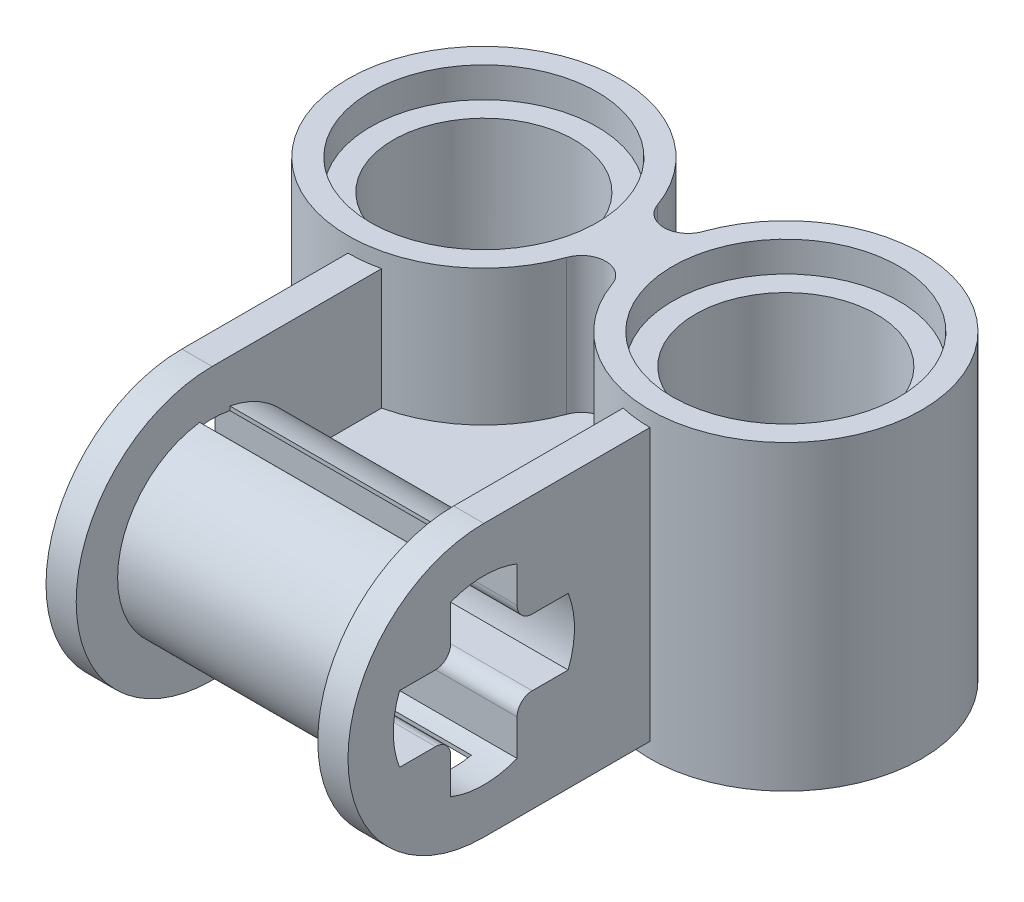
ISO-10303-21;
HEADER;
FILE_DESCRIPTION(('STEP AP214'),'2;1');
FILE_NAME('part.step','',(''),(''),'','','');
FILE_SCHEMA(('AUTOMOTIVE_DESIGN { 1 0 10303 214 1 1 1 1 }'));
ENDSEC;
DATA;
#1=APPLICATION_CONTEXT('core data for automotive mechanical design processes');
#2=APPLICATION_PROTOCOL_DEFINITION('international standard','automotive_design',2000,#1);
#3=PRODUCT_CONTEXT('',#1,'mechanical');
#4=PRODUCT('Part','Part','',(#3));
#5=PRODUCT_RELATED_PRODUCT_CATEGORY('part','',(#4));
#6=PRODUCT_DEFINITION_FORMATION('','',#4);
#7=PRODUCT_DEFINITION_CONTEXT('part definition',#1,'design');
#8=PRODUCT_DEFINITION('design','',#6,#7);
#9=PRODUCT_DEFINITION_SHAPE('','',#8);
#10=(LENGTH_UNIT() NAMED_UNIT(*) SI_UNIT(.MILLI.,.METRE.));
#11=(NAMED_UNIT(*) PLANE_ANGLE_UNIT() SI_UNIT($,.RADIAN.));
#12=(NAMED_UNIT(*) SI_UNIT($,.STERADIAN.) SOLID_ANGLE_UNIT());
#13=UNCERTAINTY_MEASURE_WITH_UNIT(LENGTH_MEASURE(1.E-05),#10,'distance_accuracy_value','');
#14=(GEOMETRIC_REPRESENTATION_CONTEXT(3) GLOBAL_UNCERTAINTY_ASSIGNED_CONTEXT((#13)) GLOBAL_UNIT_ASSIGNED_CONTEXT((#10,
#11,#12)) REPRESENTATION_CONTEXT('',''));
#15=CARTESIAN_POINT('',(0.,0.,0.));
#16=DIRECTION('',(0.,0.,1.));
#17=DIRECTION('',(1.,0.,0.));
#18=AXIS2_PLACEMENT_3D('',#15,#16,#17);
#19=CARTESIAN_POINT('',(7.2,0.,8.));
#20=DIRECTION('',(-1.,0.,0.));
#21=DIRECTION('',(0.,0.,1.));
#22=AXIS2_PLACEMENT_3D('',#19,#20,#21);
#23=CYLINDRICAL_SURFACE('',#22,2.50313690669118);
#24=DIRECTION('',(-1.,0.,0.));
#25=VECTOR('',#24,1.);
#26=CARTESIAN_POINT('',(7.2,2.45843066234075,7.5290296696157));
#27=LINE('',#26,#25);
#28=CARTESIAN_POINT('',(7.2,2.45843066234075,7.5290296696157));
#29=VERTEX_POINT('',#28);
#30=CARTESIAN_POINT('',(0.8,2.45843066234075,7.5290296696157));
#31=VERTEX_POINT('',#30);
#32=EDGE_CURVE('E49',#29,#31,#27,.T.);
#33=ORIENTED_EDGE('',*,*,#32,.F.);
#34=CARTESIAN_POINT('',(7.2,0.,8.));
#35=DIRECTION('',(-1.,0.,0.));
#36=DIRECTION('',(0.,0.,-1.));
#37=AXIS2_PLACEMENT_3D('',#34,#35,#36);
#38=CIRCLE('',#37,2.50313690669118);
#39=CARTESIAN_POINT('',(7.2,0.399999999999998,5.5290296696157));
#40=VERTEX_POINT('',#39);
#41=EDGE_CURVE('E376',#29,#40,#38,.T.);
#42=ORIENTED_EDGE('',*,*,#41,.T.);
#43=DIRECTION('',(-1.,0.,0.));
#44=VECTOR('',#43,1.);
#45=CARTESIAN_POINT('',(7.2,0.399999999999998,5.5290296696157));
#46=LINE('',#45,#44);
#47=CARTESIAN_POINT('',(0.8,0.399999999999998,5.5290296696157));
#48=VERTEX_POINT('',#47);
#49=EDGE_CURVE('E391',#40,#48,#46,.T.);
#50=ORIENTED_EDGE('',*,*,#49,.T.);
#51=CARTESIAN_POINT('',(0.8,0.,8.));
#52=DIRECTION('',(-1.,0.,0.));
#53=DIRECTION('',(0.,0.,-1.));
#54=AXIS2_PLACEMENT_3D('',#51,#52,#53);
#55=CIRCLE('',#54,2.50313690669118);
#56=EDGE_CURVE('E359',#31,#48,#55,.T.);
#57=ORIENTED_EDGE('',*,*,#56,.F.);
#58=EDGE_LOOP('',(#33,#42,#50,#57));
#59=FACE_BOUND('',#58,.T.);
#60=ADVANCED_FACE('F40',(#59),#23,.T.);
#61=DIRECTION('',(-1.,0.,0.));
#62=VECTOR('',#61,1.);
#63=CARTESIAN_POINT('',(7.2,-2.45843066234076,7.5290296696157));
#64=LINE('',#63,#62);
#65=CARTESIAN_POINT('',(0.8,-2.45843066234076,7.5290296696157));
#66=VERTEX_POINT('',#65);
#67=CARTESIAN_POINT('',(7.2,-2.45843066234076,7.5290296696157));
#68=VERTEX_POINT('',#67);
#69=EDGE_CURVE('E12',#66,#68,#64,.F.);
#70=ORIENTED_EDGE('',*,*,#69,.F.);
#71=CARTESIAN_POINT('',(0.8,-0.400000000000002,5.5290296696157));
#72=VERTEX_POINT('',#71);
#73=EDGE_CURVE('E358',#72,#66,#55,.T.);
#74=ORIENTED_EDGE('',*,*,#73,.F.);
#75=DIRECTION('',(-1.,0.,0.));
#76=VECTOR('',#75,1.);
#77=CARTESIAN_POINT('',(7.2,-0.400000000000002,5.5290296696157));
#78=LINE('',#77,#76);
#79=CARTESIAN_POINT('',(7.2,-0.400000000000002,5.5290296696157));
#80=VERTEX_POINT('',#79);
#81=EDGE_CURVE('E388',#80,#72,#78,.T.);
#82=ORIENTED_EDGE('',*,*,#81,.F.);
#83=EDGE_CURVE('E377',#80,#68,#38,.T.);
#84=ORIENTED_EDGE('',*,*,#83,.T.);
#85=EDGE_LOOP('',(#70,#74,#82,#84));
#86=FACE_BOUND('',#85,.T.);
#87=ADVANCED_FACE('F884',(#86),#23,.T.);
#88=CARTESIAN_POINT('',(0.,-3.6,0.));
#89=DIRECTION('',(0.,1.,0.));
#90=DIRECTION('',(0.,0.,1.));
#91=AXIS2_PLACEMENT_3D('',#88,#89,#90);
#92=PLANE('',#91);
#93=CARTESIAN_POINT('',(0.,-3.6,0.));
#94=DIRECTION('',(0.,-1.,0.));
#95=DIRECTION('',(0.,0.,1.));
#96=AXIS2_PLACEMENT_3D('',#93,#94,#95);
#97=CIRCLE('',#96,3.6);
#98=CARTESIAN_POINT('',(0.8,-3.6,3.50998575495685));
#99=VERTEX_POINT('',#98);
#100=CARTESIAN_POINT('',(0.,-3.6,3.6));
#101=VERTEX_POINT('',#100);
#102=EDGE_CURVE('E547',#99,#101,#97,.T.);
#103=ORIENTED_EDGE('',*,*,#102,.F.);
#104=DIRECTION('',(0.,0.,-1.));
#105=VECTOR('',#104,1.);
#106=CARTESIAN_POINT('',(0.8,-3.6,0.));
#107=LINE('',#106,#105);
#108=CARTESIAN_POINT('',(0.8,-3.6,8.));
#109=VERTEX_POINT('',#108);
#110=EDGE_CURVE('E398',#109,#99,#107,.T.);
#111=ORIENTED_EDGE('',*,*,#110,.F.);
#112=DIRECTION('',(1.,0.,0.));
#113=VECTOR('',#112,1.);
#114=CARTESIAN_POINT('',(-3.6,-3.6,8.));
#115=LINE('',#114,#113);
#116=CARTESIAN_POINT('',(0.,-3.6,8.));
#117=VERTEX_POINT('',#116);
#118=EDGE_CURVE('E524',#117,#109,#115,.T.);
#119=ORIENTED_EDGE('',*,*,#118,.F.);
#120=DIRECTION('',(0.,0.,1.));
#121=VECTOR('',#120,1.);
#122=CARTESIAN_POINT('',(0.,-3.6,3.6));
#123=LINE('',#122,#121);
#124=EDGE_CURVE('E550',#101,#117,#123,.T.);
#125=ORIENTED_EDGE('',*,*,#124,.F.);
#126=EDGE_LOOP('',(#103,#111,#119,#125));
#127=FACE_BOUND('',#126,.T.);
#128=ADVANCED_FACE('F946',(#127),#92,.F.);
#129=DIRECTION('',(0.,0.,-1.));
#130=VECTOR('',#129,1.);
#131=CARTESIAN_POINT('',(7.2,-3.6,0.));
#132=LINE('',#131,#130);
#133=CARTESIAN_POINT('',(7.2,-3.6,8.));
#134=VERTEX_POINT('',#133);
#135=CARTESIAN_POINT('',(7.2,-3.6,3.50998575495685));
#136=VERTEX_POINT('',#135);
#137=EDGE_CURVE('E404',#134,#136,#132,.T.);
#138=ORIENTED_EDGE('',*,*,#137,.T.);
#139=CARTESIAN_POINT('',(8.,-3.6,0.));
#140=DIRECTION('',(0.,-1.,0.));
#141=DIRECTION('',(0.,0.,1.));
#142=AXIS2_PLACEMENT_3D('',#139,#140,#141);
#143=CIRCLE('',#142,3.6);
#144=CARTESIAN_POINT('',(8.,-3.6,3.6));
#145=VERTEX_POINT('',#144);
#146=EDGE_CURVE('E557',#145,#136,#143,.T.);
#147=ORIENTED_EDGE('',*,*,#146,.F.);
#148=DIRECTION('',(0.,0.,-1.));
#149=VECTOR('',#148,1.);
#150=CARTESIAN_POINT('',(8.,-3.6,19.6));
#151=LINE('',#150,#149);
#152=CARTESIAN_POINT('',(8.,-3.6,8.));
#153=VERTEX_POINT('',#152);
#154=EDGE_CURVE('E554',#153,#145,#151,.T.);
#155=ORIENTED_EDGE('',*,*,#154,.F.);
#156=EDGE_CURVE('E529',#134,#153,#115,.T.);
#157=ORIENTED_EDGE('',*,*,#156,.F.);
#158=EDGE_LOOP('',(#138,#147,#155,#157));
#159=FACE_BOUND('',#158,.T.);
#160=ADVANCED_FACE('F993',(#159),#92,.F.);
#161=CARTESIAN_POINT('',(0.,3.6,0.));
#162=DIRECTION('',(0.,1.,0.));
#163=DIRECTION('',(0.,0.,1.));
#164=AXIS2_PLACEMENT_3D('',#161,#162,#163);
#165=PLANE('',#164);
#166=CARTESIAN_POINT('',(8.,3.6,0.));
#167=DIRECTION('',(0.,-1.,0.));
#168=DIRECTION('',(0.,0.,1.));
#169=AXIS2_PLACEMENT_3D('',#166,#167,#168);
#170=CIRCLE('',#169,3.6);
#171=CARTESIAN_POINT('',(8.,3.6,3.6));
#172=VERTEX_POINT('',#171);
#173=CARTESIAN_POINT('',(7.2,3.6,3.50998575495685));
#174=VERTEX_POINT('',#173);
#175=EDGE_CURVE('E543',#172,#174,#170,.T.);
#176=ORIENTED_EDGE('',*,*,#175,.T.);
#177=DIRECTION('',(0.,0.,-1.));
#178=VECTOR('',#177,1.);
#179=CARTESIAN_POINT('',(7.2,3.6,0.));
#180=LINE('',#179,#178);
#181=CARTESIAN_POINT('',(7.2,3.6,8.));
#182=VERTEX_POINT('',#181);
#183=EDGE_CURVE('E401',#182,#174,#180,.T.);
#184=ORIENTED_EDGE('',*,*,#183,.F.);
#185=DIRECTION('',(1.,0.,0.));
#186=VECTOR('',#185,1.);
#187=CARTESIAN_POINT('',(-3.6,3.6,8.));
#188=LINE('',#187,#186);
#189=CARTESIAN_POINT('',(8.,3.6,8.));
#190=VERTEX_POINT('',#189);
#191=EDGE_CURVE('E523',#182,#190,#188,.T.);
#192=ORIENTED_EDGE('',*,*,#191,.T.);
#193=DIRECTION('',(0.,0.,-1.));
#194=VECTOR('',#193,1.);
#195=CARTESIAN_POINT('',(8.,3.6,19.6));
#196=LINE('',#195,#194);
#197=EDGE_CURVE('E540',#190,#172,#196,.T.);
#198=ORIENTED_EDGE('',*,*,#197,.T.);
#199=EDGE_LOOP('',(#176,#184,#192,#198));
#200=FACE_BOUND('',#199,.T.);
#201=ADVANCED_FACE('F996',(#200),#165,.T.);
#202=CARTESIAN_POINT('',(-3.6,0.,8.));
#203=DIRECTION('',(1.,0.,0.));
#204=DIRECTION('',(0.,0.,-1.));
#205=AXIS2_PLACEMENT_3D('',#202,#203,#204);
#206=CYLINDRICAL_SURFACE('',#205,3.6);
#207=CARTESIAN_POINT('',(0.8,0.,8.));
#208=DIRECTION('',(1.,0.,0.));
#209=DIRECTION('',(0.,0.,-1.));
#210=AXIS2_PLACEMENT_3D('',#207,#208,#209);
#211=CIRCLE('',#210,3.6);
#212=CARTESIAN_POINT('',(0.8,3.6,8.));
#213=VERTEX_POINT('',#212);
#214=EDGE_CURVE('E763',#213,#109,#211,.T.);
#215=ORIENTED_EDGE('',*,*,#214,.F.);
#216=CARTESIAN_POINT('',(0.,3.6,8.));
#217=VERTEX_POINT('',#216);
#218=EDGE_CURVE('E530',#217,#213,#188,.T.);
#219=ORIENTED_EDGE('',*,*,#218,.F.);
#220=CARTESIAN_POINT('',(0.,0.,8.));
#221=DIRECTION('',(-1.,0.,0.));
#222=DIRECTION('',(0.,0.,1.));
#223=AXIS2_PLACEMENT_3D('',#220,#221,#222);
#224=CIRCLE('',#223,3.6);
#225=EDGE_CURVE('E697',#217,#117,#224,.F.);
#226=ORIENTED_EDGE('',*,*,#225,.T.);
#227=ORIENTED_EDGE('',*,*,#118,.T.);
#228=EDGE_LOOP('',(#215,#219,#226,#227));
#229=FACE_BOUND('',#228,.T.);
#230=ADVANCED_FACE('F999',(#229),#206,.T.);
#231=CARTESIAN_POINT('',(8.,-3.6,3.6));
#232=DIRECTION('',(1.,0.,0.));
#233=DIRECTION('',(0.,0.,-1.));
#234=AXIS2_PLACEMENT_3D('',#231,#232,#233);
#235=PLANE('',#234);
#236=CARTESIAN_POINT('',(8.,0.,8.));
#237=DIRECTION('',(1.,0.,0.));
#238=DIRECTION('',(0.,0.,-1.));
#239=AXIS2_PLACEMENT_3D('',#236,#237,#238);
#240=CIRCLE('',#239,2.4);
#241=CARTESIAN_POINT('',(8.,-0.880000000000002,5.76715428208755));
#242=VERTEX_POINT('',#241);
#243=CARTESIAN_POINT('',(8.,0.879999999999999,5.76715428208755));
#244=VERTEX_POINT('',#243);
#245=EDGE_CURVE('E407',#242,#244,#240,.T.);
#246=ORIENTED_EDGE('',*,*,#245,.F.);
#247=DIRECTION('',(0.,0.,-1.));
#248=VECTOR('',#247,1.);
#249=CARTESIAN_POINT('',(8.,-0.880000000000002,6.72));
#250=LINE('',#249,#248);
#251=CARTESIAN_POINT('',(8.,-0.880000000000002,6.72));
#252=VERTEX_POINT('',#251);
#253=EDGE_CURVE('E466',#252,#242,#250,.T.);
#254=ORIENTED_EDGE('',*,*,#253,.F.);
#255=CARTESIAN_POINT('',(8.,-1.28,6.72));
#256=DIRECTION('',(-1.,0.,0.));
#257=DIRECTION('',(0.,0.,1.));
#258=AXIS2_PLACEMENT_3D('',#255,#256,#257);
#259=CIRCLE('',#258,0.4);
#260=CARTESIAN_POINT('',(8.,-1.28,7.12));
#261=VERTEX_POINT('',#260);
#262=EDGE_CURVE('E462',#261,#252,#259,.T.);
#263=ORIENTED_EDGE('',*,*,#262,.F.);
#264=DIRECTION('',(0.,1.,0.));
#265=VECTOR('',#264,1.);
#266=CARTESIAN_POINT('',(8.,-2.23284571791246,7.12));
#267=LINE('',#266,#265);
#268=CARTESIAN_POINT('',(8.,-2.23284571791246,7.12));
#269=VERTEX_POINT('',#268);
#270=EDGE_CURVE('E458',#269,#261,#267,.T.);
#271=ORIENTED_EDGE('',*,*,#270,.F.);
#272=CARTESIAN_POINT('',(8.,0.,8.));
#273=DIRECTION('',(1.,0.,0.));
#274=DIRECTION('',(0.,0.,-1.));
#275=AXIS2_PLACEMENT_3D('',#272,#273,#274);
#276=CIRCLE('',#275,2.4);
#277=CARTESIAN_POINT('',(8.,-2.23284571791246,8.88));
#278=VERTEX_POINT('',#277);
#279=EDGE_CURVE('E454',#278,#269,#276,.T.);
#280=ORIENTED_EDGE('',*,*,#279,.F.);
#281=DIRECTION('',(0.,-1.,0.));
#282=VECTOR('',#281,1.);
#283=CARTESIAN_POINT('',(8.,-1.28,8.88));
#284=LINE('',#283,#282);
#285=CARTESIAN_POINT('',(8.,-1.28,8.88));
#286=VERTEX_POINT('',#285);
#287=EDGE_CURVE('E450',#286,#278,#284,.T.);
#288=ORIENTED_EDGE('',*,*,#287,.F.);
#289=CARTESIAN_POINT('',(8.,-1.28,9.28));
#290=DIRECTION('',(-1.,0.,0.));
#291=DIRECTION('',(0.,0.,-1.));
#292=AXIS2_PLACEMENT_3D('',#289,#290,#291);
#293=CIRCLE('',#292,0.4);
#294=CARTESIAN_POINT('',(8.,-0.880000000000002,9.28));
#295=VERTEX_POINT('',#294);
#296=EDGE_CURVE('E446',#295,#286,#293,.T.);
#297=ORIENTED_EDGE('',*,*,#296,.F.);
#298=DIRECTION('',(0.,0.,-1.));
#299=VECTOR('',#298,1.);
#300=CARTESIAN_POINT('',(8.,-0.880000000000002,10.2328457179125));
#301=LINE('',#300,#299);
#302=CARTESIAN_POINT('',(8.,-0.880000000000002,10.2328457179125));
#303=VERTEX_POINT('',#302);
#304=EDGE_CURVE('E442',#303,#295,#301,.T.);
#305=ORIENTED_EDGE('',*,*,#304,.F.);
#306=CARTESIAN_POINT('',(8.,0.,8.));
#307=DIRECTION('',(1.,0.,0.));
#308=DIRECTION('',(0.,0.,-1.));
#309=AXIS2_PLACEMENT_3D('',#306,#307,#308);
#310=CIRCLE('',#309,2.4);
#311=CARTESIAN_POINT('',(8.,0.879999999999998,10.2328457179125));
#312=VERTEX_POINT('',#311);
#313=EDGE_CURVE('E438',#312,#303,#310,.T.);
#314=ORIENTED_EDGE('',*,*,#313,.F.);
#315=DIRECTION('',(0.,0.,1.));
#316=VECTOR('',#315,1.);
#317=CARTESIAN_POINT('',(8.,0.879999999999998,9.28));
#318=LINE('',#317,#316);
#319=CARTESIAN_POINT('',(8.,0.879999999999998,9.28));
#320=VERTEX_POINT('',#319);
#321=EDGE_CURVE('E434',#320,#312,#318,.T.);
#322=ORIENTED_EDGE('',*,*,#321,.F.);
#323=CARTESIAN_POINT('',(8.,1.28,9.28));
#324=DIRECTION('',(-1.,0.,0.));
#325=DIRECTION('',(0.,0.,-1.));
#326=AXIS2_PLACEMENT_3D('',#323,#324,#325);
#327=CIRCLE('',#326,0.4);
#328=CARTESIAN_POINT('',(8.,1.28,8.88));
#329=VERTEX_POINT('',#328);
#330=EDGE_CURVE('E430',#329,#320,#327,.T.);
#331=ORIENTED_EDGE('',*,*,#330,.F.);
#332=DIRECTION('',(0.,-1.,0.));
#333=VECTOR('',#332,1.);
#334=CARTESIAN_POINT('',(8.,2.23284571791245,8.88));
#335=LINE('',#334,#333);
#336=CARTESIAN_POINT('',(8.,2.23284571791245,8.88));
#337=VERTEX_POINT('',#336);
#338=EDGE_CURVE('E426',#337,#329,#335,.T.);
#339=ORIENTED_EDGE('',*,*,#338,.F.);
#340=CARTESIAN_POINT('',(8.,0.,8.));
#341=DIRECTION('',(1.,0.,0.));
#342=DIRECTION('',(0.,0.,-1.));
#343=AXIS2_PLACEMENT_3D('',#340,#341,#342);
#344=CIRCLE('',#343,2.4);
#345=CARTESIAN_POINT('',(8.,2.23284571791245,7.12));
#346=VERTEX_POINT('',#345);
#347=EDGE_CURVE('E422',#346,#337,#344,.T.);
#348=ORIENTED_EDGE('',*,*,#347,.F.);
#349=DIRECTION('',(0.,1.,0.));
#350=VECTOR('',#349,1.);
#351=CARTESIAN_POINT('',(8.,1.28,7.12));
#352=LINE('',#351,#350);
#353=CARTESIAN_POINT('',(8.,1.28,7.12));
#354=VERTEX_POINT('',#353);
#355=EDGE_CURVE('E418',#354,#346,#352,.T.);
#356=ORIENTED_EDGE('',*,*,#355,.F.);
#357=CARTESIAN_POINT('',(8.,1.28,6.72));
#358=DIRECTION('',(-1.,0.,0.));
#359=DIRECTION('',(0.,0.,1.));
#360=AXIS2_PLACEMENT_3D('',#357,#358,#359);
#361=CIRCLE('',#360,0.4);
#362=CARTESIAN_POINT('',(8.,0.879999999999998,6.72));
#363=VERTEX_POINT('',#362);
#364=EDGE_CURVE('E414',#363,#354,#361,.T.);
#365=ORIENTED_EDGE('',*,*,#364,.F.);
#366=DIRECTION('',(0.,0.,1.));
#367=VECTOR('',#366,1.);
#368=CARTESIAN_POINT('',(8.,0.879999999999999,5.76715428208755));
#369=LINE('',#368,#367);
#370=EDGE_CURVE('E410',#244,#363,#369,.T.);
#371=ORIENTED_EDGE('',*,*,#370,.F.);
#372=EDGE_LOOP('',(#246,#254,#263,#271,#280,#288,#297,#305,#314,#322,#331,#339,#348,#356,#365,#371));
#373=FACE_BOUND('',#372,.T.);
#374=CARTESIAN_POINT('',(8.,0.,8.));
#375=DIRECTION('',(-1.,0.,0.));
#376=DIRECTION('',(0.,0.,-1.));
#377=AXIS2_PLACEMENT_3D('',#374,#375,#376);
#378=CIRCLE('',#377,3.6);
#379=EDGE_CURVE('E474',#153,#190,#378,.T.);
#380=ORIENTED_EDGE('',*,*,#379,.F.);
#381=ORIENTED_EDGE('',*,*,#154,.T.);
#382=DIRECTION('',(0.,1.,0.));
#383=VECTOR('',#382,1.);
#384=CARTESIAN_POINT('',(8.,4.,3.6));
#385=LINE('',#384,#383);
#386=EDGE_CURVE('E573',#145,#172,#385,.T.);
#387=ORIENTED_EDGE('',*,*,#386,.T.);
#388=ORIENTED_EDGE('',*,*,#197,.F.);
#389=EDGE_LOOP('',(#380,#381,#387,#388));
#390=FACE_BOUND('',#389,.T.);
#391=ADVANCED_FACE('F992',(#373,#390),#235,.T.);
#392=CARTESIAN_POINT('',(0.,-3.6,19.6));
#393=DIRECTION('',(-1.,0.,0.));
#394=DIRECTION('',(0.,0.,1.));
#395=AXIS2_PLACEMENT_3D('',#392,#393,#394);
#396=PLANE('',#395);
#397=CARTESIAN_POINT('',(0.,0.,8.));
#398=DIRECTION('',(-1.,0.,0.));
#399=DIRECTION('',(0.,0.,1.));
#400=AXIS2_PLACEMENT_3D('',#397,#398,#399);
#401=CIRCLE('',#400,2.4);
#402=CARTESIAN_POINT('',(0.,0.879999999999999,5.76715428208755));
#403=VERTEX_POINT('',#402);
#404=CARTESIAN_POINT('',(0.,-0.880000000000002,5.76715428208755));
#405=VERTEX_POINT('',#404);
#406=EDGE_CURVE('E760',#403,#405,#401,.T.);
#407=ORIENTED_EDGE('',*,*,#406,.F.);
#408=DIRECTION('',(0.,0.,-1.));
#409=VECTOR('',#408,1.);
#410=CARTESIAN_POINT('',(0.,0.879999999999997,19.6));
#411=LINE('',#410,#409);
#412=CARTESIAN_POINT('',(0.,0.879999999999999,6.72));
#413=VERTEX_POINT('',#412);
#414=EDGE_CURVE('E714',#413,#403,#411,.T.);
#415=ORIENTED_EDGE('',*,*,#414,.F.);
#416=CARTESIAN_POINT('',(0.,1.28,6.72));
#417=DIRECTION('',(-1.,0.,0.));
#418=DIRECTION('',(0.,0.,1.));
#419=AXIS2_PLACEMENT_3D('',#416,#417,#418);
#420=CIRCLE('',#419,0.4);
#421=CARTESIAN_POINT('',(0.,1.28,7.12));
#422=VERTEX_POINT('',#421);
#423=EDGE_CURVE('E717',#422,#413,#420,.F.);
#424=ORIENTED_EDGE('',*,*,#423,.F.);
#425=DIRECTION('',(0.,-1.,0.));
#426=VECTOR('',#425,1.);
#427=CARTESIAN_POINT('',(0.,-3.6,7.12));
#428=LINE('',#427,#426);
#429=CARTESIAN_POINT('',(0.,2.23284571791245,7.12));
#430=VERTEX_POINT('',#429);
#431=EDGE_CURVE('E721',#430,#422,#428,.T.);
#432=ORIENTED_EDGE('',*,*,#431,.F.);
#433=CARTESIAN_POINT('',(0.,0.,8.));
#434=DIRECTION('',(-1.,0.,0.));
#435=DIRECTION('',(0.,0.,1.));
#436=AXIS2_PLACEMENT_3D('',#433,#434,#435);
#437=CIRCLE('',#436,2.4);
#438=CARTESIAN_POINT('',(0.,2.23284571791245,8.88));
#439=VERTEX_POINT('',#438);
#440=EDGE_CURVE('E724',#439,#430,#437,.T.);
#441=ORIENTED_EDGE('',*,*,#440,.F.);
#442=DIRECTION('',(0.,1.,0.));
#443=VECTOR('',#442,1.);
#444=CARTESIAN_POINT('',(0.,-3.6,8.88));
#445=LINE('',#444,#443);
#446=CARTESIAN_POINT('',(0.,1.28,8.88));
#447=VERTEX_POINT('',#446);
#448=EDGE_CURVE('E727',#447,#439,#445,.T.);
#449=ORIENTED_EDGE('',*,*,#448,.F.);
#450=CARTESIAN_POINT('',(0.,1.28,9.28));
#451=DIRECTION('',(-1.,0.,0.));
#452=DIRECTION('',(0.,0.,1.));
#453=AXIS2_PLACEMENT_3D('',#450,#451,#452);
#454=CIRCLE('',#453,0.4);
#455=CARTESIAN_POINT('',(0.,0.879999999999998,9.28));
#456=VERTEX_POINT('',#455);
#457=EDGE_CURVE('E730',#456,#447,#454,.F.);
#458=ORIENTED_EDGE('',*,*,#457,.F.);
#459=DIRECTION('',(0.,0.,-1.));
#460=VECTOR('',#459,1.);
#461=CARTESIAN_POINT('',(0.,0.879999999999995,19.6));
#462=LINE('',#461,#460);
#463=CARTESIAN_POINT('',(0.,0.879999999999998,10.2328457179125));
#464=VERTEX_POINT('',#463);
#465=EDGE_CURVE('E733',#464,#456,#462,.T.);
#466=ORIENTED_EDGE('',*,*,#465,.F.);
#467=CARTESIAN_POINT('',(0.,0.,8.));
#468=DIRECTION('',(-1.,0.,0.));
#469=DIRECTION('',(0.,0.,1.));
#470=AXIS2_PLACEMENT_3D('',#467,#468,#469);
#471=CIRCLE('',#470,2.4);
#472=CARTESIAN_POINT('',(0.,-0.880000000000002,10.2328457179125));
#473=VERTEX_POINT('',#472);
#474=EDGE_CURVE('E736',#473,#464,#471,.T.);
#475=ORIENTED_EDGE('',*,*,#474,.F.);
#476=DIRECTION('',(0.,0.,1.));
#477=VECTOR('',#476,1.);
#478=CARTESIAN_POINT('',(0.,-0.880000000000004,19.6));
#479=LINE('',#478,#477);
#480=CARTESIAN_POINT('',(0.,-0.880000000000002,9.28));
#481=VERTEX_POINT('',#480);
#482=EDGE_CURVE('E739',#481,#473,#479,.T.);
#483=ORIENTED_EDGE('',*,*,#482,.F.);
#484=CARTESIAN_POINT('',(0.,-1.28,9.28));
#485=DIRECTION('',(-1.,0.,0.));
#486=DIRECTION('',(0.,0.,1.));
#487=AXIS2_PLACEMENT_3D('',#484,#485,#486);
#488=CIRCLE('',#487,0.4);
#489=CARTESIAN_POINT('',(0.,-1.28,8.88));
#490=VERTEX_POINT('',#489);
#491=EDGE_CURVE('E742',#490,#481,#488,.F.);
#492=ORIENTED_EDGE('',*,*,#491,.F.);
#493=DIRECTION('',(0.,1.,0.));
#494=VECTOR('',#493,1.);
#495=CARTESIAN_POINT('',(0.,-3.6,8.88));
#496=LINE('',#495,#494);
#497=CARTESIAN_POINT('',(0.,-2.23284571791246,8.88));
#498=VERTEX_POINT('',#497);
#499=EDGE_CURVE('E745',#498,#490,#496,.T.);
#500=ORIENTED_EDGE('',*,*,#499,.F.);
#501=CARTESIAN_POINT('',(0.,0.,8.));
#502=DIRECTION('',(-1.,0.,0.));
#503=DIRECTION('',(0.,0.,1.));
#504=AXIS2_PLACEMENT_3D('',#501,#502,#503);
#505=CIRCLE('',#504,2.4);
#506=CARTESIAN_POINT('',(0.,-2.23284571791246,7.12));
#507=VERTEX_POINT('',#506);
#508=EDGE_CURVE('E748',#507,#498,#505,.T.);
#509=ORIENTED_EDGE('',*,*,#508,.F.);
#510=DIRECTION('',(0.,-1.,0.));
#511=VECTOR('',#510,1.);
#512=CARTESIAN_POINT('',(0.,-3.6,7.12));
#513=LINE('',#512,#511);
#514=CARTESIAN_POINT('',(0.,-1.28,7.12));
#515=VERTEX_POINT('',#514);
#516=EDGE_CURVE('E751',#515,#507,#513,.T.);
#517=ORIENTED_EDGE('',*,*,#516,.F.);
#518=CARTESIAN_POINT('',(0.,-1.28,6.72));
#519=DIRECTION('',(-1.,0.,0.));
#520=DIRECTION('',(0.,0.,1.));
#521=AXIS2_PLACEMENT_3D('',#518,#519,#520);
#522=CIRCLE('',#521,0.4);
#523=CARTESIAN_POINT('',(0.,-0.880000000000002,6.72));
#524=VERTEX_POINT('',#523);
#525=EDGE_CURVE('E754',#524,#515,#522,.F.);
#526=ORIENTED_EDGE('',*,*,#525,.F.);
#527=DIRECTION('',(0.,0.,1.));
#528=VECTOR('',#527,1.);
#529=CARTESIAN_POINT('',(0.,-0.880000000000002,19.6));
#530=LINE('',#529,#528);
#531=EDGE_CURVE('E757',#405,#524,#530,.T.);
#532=ORIENTED_EDGE('',*,*,#531,.F.);
#533=EDGE_LOOP('',(#407,#415,#424,#432,#441,#449,#458,#466,#475,#483,#492,#500,#509,#517,#526,#532));
#534=FACE_BOUND('',#533,.T.);
#535=ORIENTED_EDGE('',*,*,#225,.F.);
#536=DIRECTION('',(0.,0.,1.));
#537=VECTOR('',#536,1.);
#538=CARTESIAN_POINT('',(0.,3.6,3.6));
#539=LINE('',#538,#537);
#540=CARTESIAN_POINT('',(0.,3.6,3.6));
#541=VERTEX_POINT('',#540);
#542=EDGE_CURVE('E536',#541,#217,#539,.T.);
#543=ORIENTED_EDGE('',*,*,#542,.F.);
#544=DIRECTION('',(0.,-1.,0.));
#545=VECTOR('',#544,1.);
#546=CARTESIAN_POINT('',(0.,4.,3.6));
#547=LINE('',#546,#545);
#548=EDGE_CURVE('E569',#541,#101,#547,.T.);
#549=ORIENTED_EDGE('',*,*,#548,.T.);
#550=ORIENTED_EDGE('',*,*,#124,.T.);
#551=EDGE_LOOP('',(#535,#543,#549,#550));
#552=FACE_BOUND('',#551,.T.);
#553=ADVANCED_FACE('F1011',(#534,#552),#396,.T.);
#554=DIRECTION('',(0.,0.,-1.));
#555=VECTOR('',#554,1.);
#556=CARTESIAN_POINT('',(0.8,3.6,0.));
#557=LINE('',#556,#555);
#558=CARTESIAN_POINT('',(0.8,3.6,3.50998575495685));
#559=VERTEX_POINT('',#558);
#560=EDGE_CURVE('E395',#213,#559,#557,.T.);
#561=ORIENTED_EDGE('',*,*,#560,.T.);
#562=CARTESIAN_POINT('',(0.,3.6,0.));
#563=DIRECTION('',(0.,-1.,0.));
#564=DIRECTION('',(0.,0.,1.));
#565=AXIS2_PLACEMENT_3D('',#562,#563,#564);
#566=CIRCLE('',#565,3.6);
#567=EDGE_CURVE('E528',#559,#541,#566,.T.);
#568=ORIENTED_EDGE('',*,*,#567,.T.);
#569=ORIENTED_EDGE('',*,*,#542,.T.);
#570=ORIENTED_EDGE('',*,*,#218,.T.);
#571=EDGE_LOOP('',(#561,#568,#569,#570));
#572=FACE_BOUND('',#571,.T.);
#573=ADVANCED_FACE('F1001',(#572),#165,.T.);
#574=CARTESIAN_POINT('',(0.,-4.,0.));
#575=DIRECTION('',(0.,1.,0.));
#576=DIRECTION('',(0.,0.,1.));
#577=AXIS2_PLACEMENT_3D('',#574,#575,#576);
#578=CYLINDRICAL_SURFACE('',#577,2.4);
#579=CARTESIAN_POINT('',(0.,3.2,0.));
#580=DIRECTION('',(0.,1.,0.));
#581=DIRECTION('',(0.,0.,1.));
#582=AXIS2_PLACEMENT_3D('',#579,#580,#581);
#583=CIRCLE('',#582,2.4);
#584=CARTESIAN_POINT('',(0.,3.2,2.4));
#585=VERTEX_POINT('',#584);
#586=EDGE_CURVE('E645',#585,#585,#583,.F.);
#587=ORIENTED_EDGE('',*,*,#586,.F.);
#588=EDGE_LOOP('',(#587));
#589=FACE_BOUND('',#588,.T.);
#590=CARTESIAN_POINT('',(0.,-3.2,0.));
#591=DIRECTION('',(0.,-1.,0.));
#592=DIRECTION('',(0.,0.,-1.));
#593=AXIS2_PLACEMENT_3D('',#590,#591,#592);
#594=CIRCLE('',#593,2.4);
#595=CARTESIAN_POINT('',(0.,-3.2,-2.4));
#596=VERTEX_POINT('',#595);
#597=EDGE_CURVE('E611',#596,#596,#594,.F.);
#598=ORIENTED_EDGE('',*,*,#597,.F.);
#599=EDGE_LOOP('',(#598));
#600=FACE_BOUND('',#599,.T.);
#601=ADVANCED_FACE('F1010',(#589,#600),#578,.F.);
#602=CARTESIAN_POINT('',(8.,-4.,0.));
#603=DIRECTION('',(0.,1.,0.));
#604=DIRECTION('',(0.,0.,1.));
#605=AXIS2_PLACEMENT_3D('',#602,#603,#604);
#606=CYLINDRICAL_SURFACE('',#605,2.4);
#607=CARTESIAN_POINT('',(8.,3.2,0.));
#608=DIRECTION('',(0.,1.,0.));
#609=DIRECTION('',(0.,0.,1.));
#610=AXIS2_PLACEMENT_3D('',#607,#608,#609);
#611=CIRCLE('',#610,2.4);
#612=CARTESIAN_POINT('',(8.,3.2,2.4));
#613=VERTEX_POINT('',#612);
#614=EDGE_CURVE('E598',#613,#613,#611,.F.);
#615=ORIENTED_EDGE('',*,*,#614,.F.);
#616=EDGE_LOOP('',(#615));
#617=FACE_BOUND('',#616,.T.);
#618=CARTESIAN_POINT('',(8.,-3.2,0.));
#619=DIRECTION('',(0.,-1.,0.));
#620=DIRECTION('',(0.,0.,-1.));
#621=AXIS2_PLACEMENT_3D('',#618,#619,#620);
#622=CIRCLE('',#621,2.4);
#623=CARTESIAN_POINT('',(8.,-3.2,-2.4));
#624=VERTEX_POINT('',#623);
#625=EDGE_CURVE('E582',#624,#624,#622,.F.);
#626=ORIENTED_EDGE('',*,*,#625,.F.);
#627=EDGE_LOOP('',(#626));
#628=FACE_BOUND('',#627,.T.);
#629=ADVANCED_FACE('F1018',(#617,#628),#606,.F.);
#630=CARTESIAN_POINT('',(0.,-4.,-3.6));
#631=DIRECTION('',(0.,0.,-1.));
#632=DIRECTION('',(-1.,0.,0.));
#633=AXIS2_PLACEMENT_3D('',#630,#631,#632);
#634=PLANE('',#633);
#635=DIRECTION('',(0.,1.,0.));
#636=VECTOR('',#635,1.);
#637=CARTESIAN_POINT('',(8.,-4.,-3.6));
#638=LINE('',#637,#636);
#639=CARTESIAN_POINT('',(8.,-0.8,-3.6));
#640=VERTEX_POINT('',#639);
#641=CARTESIAN_POINT('',(8.,0.8,-3.6));
#642=VERTEX_POINT('',#641);
#643=EDGE_CURVE('E693',#640,#642,#638,.T.);
#644=ORIENTED_EDGE('',*,*,#643,.F.);
#645=DIRECTION('',(-1.,0.,0.));
#646=VECTOR('',#645,1.);
#647=CARTESIAN_POINT('',(0.,-0.8,-3.6));
#648=LINE('',#647,#646);
#649=CARTESIAN_POINT('',(0.,-0.8,-3.6));
#650=VERTEX_POINT('',#649);
#651=EDGE_CURVE('E620',#640,#650,#648,.T.);
#652=ORIENTED_EDGE('',*,*,#651,.T.);
#653=DIRECTION('',(0.,1.,0.));
#654=VECTOR('',#653,1.);
#655=CARTESIAN_POINT('',(0.,-4.,-3.6));
#656=LINE('',#655,#654);
#657=CARTESIAN_POINT('',(0.,0.8,-3.6));
#658=VERTEX_POINT('',#657);
#659=EDGE_CURVE('E694',#650,#658,#656,.T.);
#660=ORIENTED_EDGE('',*,*,#659,.T.);
#661=DIRECTION('',(-1.,0.,0.));
#662=VECTOR('',#661,1.);
#663=CARTESIAN_POINT('',(0.,0.8,-3.6));
#664=LINE('',#663,#662);
#665=EDGE_CURVE('E655',#642,#658,#664,.T.);
#666=ORIENTED_EDGE('',*,*,#665,.F.);
#667=EDGE_LOOP('',(#644,#652,#660,#666));
#668=FACE_BOUND('',#667,.T.);
#669=ADVANCED_FACE('F915',(#668),#634,.T.);
#670=CARTESIAN_POINT('',(0.,-4.,0.));
#671=DIRECTION('',(0.,1.,0.));
#672=DIRECTION('',(0.,0.,1.));
#673=AXIS2_PLACEMENT_3D('',#670,#671,#672);
#674=PLANE('',#673);
#675=CARTESIAN_POINT('',(8.,-4.,0.));
#676=DIRECTION('',(0.,1.,0.));
#677=DIRECTION('',(0.,0.,1.));
#678=AXIS2_PLACEMENT_3D('',#675,#676,#677);
#679=CIRCLE('',#678,3.);
#680=CARTESIAN_POINT('',(8.,-4.,3.));
#681=VERTEX_POINT('',#680);
#682=EDGE_CURVE('E577',#681,#681,#679,.T.);
#683=ORIENTED_EDGE('',*,*,#682,.T.);
#684=EDGE_LOOP('',(#683));
#685=FACE_BOUND('',#684,.T.);
#686=CARTESIAN_POINT('',(0.,-4.,0.));
#687=DIRECTION('',(0.,1.,0.));
#688=DIRECTION('',(0.,0.,1.));
#689=AXIS2_PLACEMENT_3D('',#686,#687,#688);
#690=CIRCLE('',#689,3.);
#691=CARTESIAN_POINT('',(0.,-4.,3.));
#692=VERTEX_POINT('',#691);
#693=EDGE_CURVE('E583',#692,#692,#690,.T.);
#694=ORIENTED_EDGE('',*,*,#693,.T.);
#695=EDGE_LOOP('',(#694));
#696=FACE_BOUND('',#695,.T.);
#697=CARTESIAN_POINT('',(8.,-4.,0.));
#698=DIRECTION('',(0.,1.,0.));
#699=DIRECTION('',(0.,0.,-1.));
#700=AXIS2_PLACEMENT_3D('',#697,#698,#699);
#701=CIRCLE('',#700,3.6);
#702=CARTESIAN_POINT('',(4.60588745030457,-4.,1.2));
#703=VERTEX_POINT('',#702);
#704=CARTESIAN_POINT('',(4.60588745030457,-4.,-1.2));
#705=VERTEX_POINT('',#704);
#706=EDGE_CURVE('E690',#703,#705,#701,.T.);
#707=ORIENTED_EDGE('',*,*,#706,.F.);
#708=CARTESIAN_POINT('',(4.,-4.,1.4142135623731));
#709=DIRECTION('',(0.,-1.,0.));
#710=DIRECTION('',(0.,0.,-1.));
#711=AXIS2_PLACEMENT_3D('',#708,#709,#710);
#712=CIRCLE('',#711,0.642640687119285);
#713=CARTESIAN_POINT('',(3.39411254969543,-4.,1.2));
#714=VERTEX_POINT('',#713);
#715=EDGE_CURVE('E561',#714,#703,#712,.T.);
#716=ORIENTED_EDGE('',*,*,#715,.F.);
#717=CARTESIAN_POINT('',(0.,-4.,0.));
#718=DIRECTION('',(0.,1.,0.));
#719=DIRECTION('',(0.,0.,1.));
#720=AXIS2_PLACEMENT_3D('',#717,#718,#719);
#721=CIRCLE('',#720,3.6);
#722=CARTESIAN_POINT('',(3.39411254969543,-4.,-1.2));
#723=VERTEX_POINT('',#722);
#724=EDGE_CURVE('E686',#723,#714,#721,.T.);
#725=ORIENTED_EDGE('',*,*,#724,.F.);
#726=CARTESIAN_POINT('',(4.,-4.,-1.41421356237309));
#727=DIRECTION('',(0.,1.,0.));
#728=DIRECTION('',(0.,0.,1.));
#729=AXIS2_PLACEMENT_3D('',#726,#727,#728);
#730=CIRCLE('',#729,0.642640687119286);
#731=EDGE_CURVE('E617',#723,#705,#730,.T.);
#732=ORIENTED_EDGE('',*,*,#731,.T.);
#733=EDGE_LOOP('',(#707,#716,#725,#732));
#734=FACE_BOUND('',#733,.T.);
#735=ADVANCED_FACE('F902',(#685,#696,#734),#674,.F.);
#736=CARTESIAN_POINT('',(0.,4.,0.));
#737=DIRECTION('',(0.,1.,0.));
#738=DIRECTION('',(0.,0.,1.));
#739=AXIS2_PLACEMENT_3D('',#736,#737,#738);
#740=PLANE('',#739);
#741=CARTESIAN_POINT('',(0.,4.,0.));
#742=DIRECTION('',(0.,1.,0.));
#743=DIRECTION('',(0.,0.,1.));
#744=AXIS2_PLACEMENT_3D('',#741,#742,#743);
#745=CIRCLE('',#744,3.);
#746=CARTESIAN_POINT('',(0.,4.,3.));
#747=VERTEX_POINT('',#746);
#748=EDGE_CURVE('E599',#747,#747,#745,.T.);
#749=ORIENTED_EDGE('',*,*,#748,.F.);
#750=EDGE_LOOP('',(#749));
#751=FACE_BOUND('',#750,.T.);
#752=CARTESIAN_POINT('',(8.,4.,0.));
#753=DIRECTION('',(0.,1.,0.));
#754=DIRECTION('',(0.,0.,1.));
#755=AXIS2_PLACEMENT_3D('',#752,#753,#754);
#756=CIRCLE('',#755,3.);
#757=CARTESIAN_POINT('',(8.,4.,3.));
#758=VERTEX_POINT('',#757);
#759=EDGE_CURVE('E607',#758,#758,#756,.T.);
#760=ORIENTED_EDGE('',*,*,#759,.F.);
#761=EDGE_LOOP('',(#760));
#762=FACE_BOUND('',#761,.T.);
#763=CARTESIAN_POINT('',(4.,4.,1.4142135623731));
#764=DIRECTION('',(0.,-1.,0.));
#765=DIRECTION('',(0.,0.,-1.));
#766=AXIS2_PLACEMENT_3D('',#763,#764,#765);
#767=CIRCLE('',#766,0.642640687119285);
#768=CARTESIAN_POINT('',(3.39411254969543,4.,1.2));
#769=VERTEX_POINT('',#768);
#770=CARTESIAN_POINT('',(4.60588745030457,4.,1.2));
#771=VERTEX_POINT('',#770);
#772=EDGE_CURVE('E565',#769,#771,#767,.T.);
#773=ORIENTED_EDGE('',*,*,#772,.T.);
#774=CARTESIAN_POINT('',(8.,4.,0.));
#775=DIRECTION('',(0.,1.,0.));
#776=DIRECTION('',(0.,0.,-1.));
#777=AXIS2_PLACEMENT_3D('',#774,#775,#776);
#778=CIRCLE('',#777,3.6);
#779=CARTESIAN_POINT('',(4.60588745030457,4.,-1.2));
#780=VERTEX_POINT('',#779);
#781=EDGE_CURVE('E683',#771,#780,#778,.T.);
#782=ORIENTED_EDGE('',*,*,#781,.T.);
#783=CARTESIAN_POINT('',(4.,4.,-1.41421356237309));
#784=DIRECTION('',(0.,1.,0.));
#785=DIRECTION('',(0.,0.,1.));
#786=AXIS2_PLACEMENT_3D('',#783,#784,#785);
#787=CIRCLE('',#786,0.642640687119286);
#788=CARTESIAN_POINT('',(3.39411254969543,4.,-1.2));
#789=VERTEX_POINT('',#788);
#790=EDGE_CURVE('E651',#789,#780,#787,.T.);
#791=ORIENTED_EDGE('',*,*,#790,.F.);
#792=CARTESIAN_POINT('',(0.,4.,0.));
#793=DIRECTION('',(0.,1.,0.));
#794=DIRECTION('',(0.,0.,1.));
#795=AXIS2_PLACEMENT_3D('',#792,#793,#794);
#796=CIRCLE('',#795,3.6);
#797=EDGE_CURVE('E672',#789,#769,#796,.T.);
#798=ORIENTED_EDGE('',*,*,#797,.T.);
#799=EDGE_LOOP('',(#773,#782,#791,#798));
#800=FACE_BOUND('',#799,.T.);
#801=ADVANCED_FACE('F928',(#751,#762,#800),#740,.T.);
#802=CARTESIAN_POINT('',(0.,-4.,0.));
#803=DIRECTION('',(0.,1.,0.));
#804=DIRECTION('',(0.,0.,1.));
#805=AXIS2_PLACEMENT_3D('',#802,#803,#804);
#806=CYLINDRICAL_SURFACE('',#805,3.6);
#807=DIRECTION('',(0.,-1.,0.));
#808=VECTOR('',#807,1.);
#809=CARTESIAN_POINT('',(0.8,-0.4,3.50998575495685));
#810=LINE('',#809,#808);
#811=CARTESIAN_POINT('',(0.8,-0.4,3.50998575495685));
#812=VERTEX_POINT('',#811);
#813=EDGE_CURVE('E817',#812,#99,#810,.T.);
#814=ORIENTED_EDGE('',*,*,#813,.T.);
#815=ORIENTED_EDGE('',*,*,#102,.T.);
#816=ORIENTED_EDGE('',*,*,#548,.F.);
#817=ORIENTED_EDGE('',*,*,#567,.F.);
#818=DIRECTION('',(0.,1.,0.));
#819=VECTOR('',#818,1.);
#820=CARTESIAN_POINT('',(0.8,0.4,3.50998575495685));
#821=LINE('',#820,#819);
#822=CARTESIAN_POINT('',(0.8,0.4,3.50998575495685));
#823=VERTEX_POINT('',#822);
#824=EDGE_CURVE('E368',#823,#559,#821,.T.);
#825=ORIENTED_EDGE('',*,*,#824,.F.);
#826=CARTESIAN_POINT('',(0.,0.4,0.));
#827=DIRECTION('',(0.,-1.,0.));
#828=DIRECTION('',(0.,0.,1.));
#829=AXIS2_PLACEMENT_3D('',#826,#827,#828);
#830=CIRCLE('',#829,3.6);
#831=CARTESIAN_POINT('',(3.39411254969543,0.4,1.2));
#832=VERTEX_POINT('',#831);
#833=EDGE_CURVE('E796',#832,#823,#830,.T.);
#834=ORIENTED_EDGE('',*,*,#833,.F.);
#835=DIRECTION('',(0.,1.,0.));
#836=VECTOR('',#835,1.);
#837=CARTESIAN_POINT('',(3.39411254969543,0.8,1.2));
#838=LINE('',#837,#836);
#839=EDGE_CURVE('E636',#832,#769,#838,.T.);
#840=ORIENTED_EDGE('',*,*,#839,.T.);
#841=ORIENTED_EDGE('',*,*,#797,.F.);
#842=DIRECTION('',(0.,1.,0.));
#843=VECTOR('',#842,1.);
#844=CARTESIAN_POINT('',(3.39411254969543,0.8,-1.2));
#845=LINE('',#844,#843);
#846=CARTESIAN_POINT('',(3.39411254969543,0.8,-1.2));
#847=VERTEX_POINT('',#846);
#848=EDGE_CURVE('E668',#847,#789,#845,.T.);
#849=ORIENTED_EDGE('',*,*,#848,.F.);
#850=CARTESIAN_POINT('',(0.,0.8,0.));
#851=DIRECTION('',(0.,-1.,0.));
#852=DIRECTION('',(0.,0.,1.));
#853=AXIS2_PLACEMENT_3D('',#850,#851,#852);
#854=CIRCLE('',#853,3.6);
#855=EDGE_CURVE('E659',#658,#847,#854,.T.);
#856=ORIENTED_EDGE('',*,*,#855,.F.);
#857=ORIENTED_EDGE('',*,*,#659,.F.);
#858=CARTESIAN_POINT('',(0.,-0.8,0.));
#859=DIRECTION('',(0.,-1.,0.));
#860=DIRECTION('',(0.,0.,1.));
#861=AXIS2_PLACEMENT_3D('',#858,#859,#860);
#862=CIRCLE('',#861,3.6);
#863=CARTESIAN_POINT('',(3.39411254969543,-0.8,-1.2));
#864=VERTEX_POINT('',#863);
#865=EDGE_CURVE('E616',#650,#864,#862,.T.);
#866=ORIENTED_EDGE('',*,*,#865,.T.);
#867=DIRECTION('',(0.,-1.,0.));
#868=VECTOR('',#867,1.);
#869=CARTESIAN_POINT('',(3.39411254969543,-0.8,-1.2));
#870=LINE('',#869,#868);
#871=EDGE_CURVE('E627',#864,#723,#870,.T.);
#872=ORIENTED_EDGE('',*,*,#871,.T.);
#873=ORIENTED_EDGE('',*,*,#724,.T.);
#874=DIRECTION('',(0.,-1.,0.));
#875=VECTOR('',#874,1.);
#876=CARTESIAN_POINT('',(3.39411254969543,-0.8,1.2));
#877=LINE('',#876,#875);
#878=CARTESIAN_POINT('',(3.39411254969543,-0.4,1.2));
#879=VERTEX_POINT('',#878);
#880=EDGE_CURVE('E631',#879,#714,#877,.T.);
#881=ORIENTED_EDGE('',*,*,#880,.F.);
#882=CARTESIAN_POINT('',(0.,-0.4,0.));
#883=DIRECTION('',(0.,-1.,0.));
#884=DIRECTION('',(0.,0.,1.));
#885=AXIS2_PLACEMENT_3D('',#882,#883,#884);
#886=CIRCLE('',#885,3.6);
#887=EDGE_CURVE('E822',#879,#812,#886,.T.);
#888=ORIENTED_EDGE('',*,*,#887,.T.);
#889=EDGE_LOOP('',(#814,#815,#816,#817,#825,#834,#840,#841,#849,#856,#857,#866,#872,#873,#881,#888));
#890=FACE_BOUND('',#889,.T.);
#891=ADVANCED_FACE('F42',(#890),#806,.T.);
#892=CARTESIAN_POINT('',(8.,-4.,0.));
#893=DIRECTION('',(0.,1.,0.));
#894=DIRECTION('',(0.,0.,1.));
#895=AXIS2_PLACEMENT_3D('',#892,#893,#894);
#896=CYLINDRICAL_SURFACE('',#895,3.6);
#897=DIRECTION('',(0.,-1.,0.));
#898=VECTOR('',#897,1.);
#899=CARTESIAN_POINT('',(4.60588745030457,-0.8,1.2));
#900=LINE('',#899,#898);
#901=CARTESIAN_POINT('',(4.60588745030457,-0.4,1.2));
#902=VERTEX_POINT('',#901);
#903=EDGE_CURVE('E642',#902,#703,#900,.T.);
#904=ORIENTED_EDGE('',*,*,#903,.T.);
#905=ORIENTED_EDGE('',*,*,#706,.T.);
#906=DIRECTION('',(0.,-1.,0.));
#907=VECTOR('',#906,1.);
#908=CARTESIAN_POINT('',(4.60588745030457,-0.8,-1.2));
#909=LINE('',#908,#907);
#910=CARTESIAN_POINT('',(4.60588745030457,-0.8,-1.2));
#911=VERTEX_POINT('',#910);
#912=EDGE_CURVE('E632',#911,#705,#909,.T.);
#913=ORIENTED_EDGE('',*,*,#912,.F.);
#914=CARTESIAN_POINT('',(8.,-0.8,0.));
#915=DIRECTION('',(0.,-1.,0.));
#916=DIRECTION('',(0.,0.,1.));
#917=AXIS2_PLACEMENT_3D('',#914,#915,#916);
#918=CIRCLE('',#917,3.6);
#919=EDGE_CURVE('E624',#911,#640,#918,.T.);
#920=ORIENTED_EDGE('',*,*,#919,.T.);
#921=ORIENTED_EDGE('',*,*,#643,.T.);
#922=CARTESIAN_POINT('',(8.,0.8,0.));
#923=DIRECTION('',(0.,-1.,0.));
#924=DIRECTION('',(0.,0.,1.));
#925=AXIS2_PLACEMENT_3D('',#922,#923,#924);
#926=CIRCLE('',#925,3.6);
#927=CARTESIAN_POINT('',(4.60588745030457,0.8,-1.2));
#928=VERTEX_POINT('',#927);
#929=EDGE_CURVE('E650',#928,#642,#926,.T.);
#930=ORIENTED_EDGE('',*,*,#929,.F.);
#931=DIRECTION('',(0.,1.,0.));
#932=VECTOR('',#931,1.);
#933=CARTESIAN_POINT('',(4.60588745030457,0.8,-1.2));
#934=LINE('',#933,#932);
#935=EDGE_CURVE('E663',#928,#780,#934,.T.);
#936=ORIENTED_EDGE('',*,*,#935,.T.);
#937=ORIENTED_EDGE('',*,*,#781,.F.);
#938=DIRECTION('',(0.,1.,0.));
#939=VECTOR('',#938,1.);
#940=CARTESIAN_POINT('',(4.60588745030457,0.8,1.2));
#941=LINE('',#940,#939);
#942=CARTESIAN_POINT('',(4.60588745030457,0.4,1.2));
#943=VERTEX_POINT('',#942);
#944=EDGE_CURVE('E667',#943,#771,#941,.T.);
#945=ORIENTED_EDGE('',*,*,#944,.F.);
#946=CARTESIAN_POINT('',(8.,0.4,0.));
#947=DIRECTION('',(0.,-1.,0.));
#948=DIRECTION('',(0.,0.,1.));
#949=AXIS2_PLACEMENT_3D('',#946,#947,#948);
#950=CIRCLE('',#949,3.6);
#951=CARTESIAN_POINT('',(7.2,0.4,3.50998575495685));
#952=VERTEX_POINT('',#951);
#953=EDGE_CURVE('E804',#952,#943,#950,.T.);
#954=ORIENTED_EDGE('',*,*,#953,.F.);
#955=DIRECTION('',(0.,1.,0.));
#956=VECTOR('',#955,1.);
#957=CARTESIAN_POINT('',(7.2,0.4,3.50998575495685));
#958=LINE('',#957,#956);
#959=EDGE_CURVE('E365',#952,#174,#958,.T.);
#960=ORIENTED_EDGE('',*,*,#959,.T.);
#961=ORIENTED_EDGE('',*,*,#175,.F.);
#962=ORIENTED_EDGE('',*,*,#386,.F.);
#963=ORIENTED_EDGE('',*,*,#146,.T.);
#964=DIRECTION('',(0.,-1.,0.));
#965=VECTOR('',#964,1.);
#966=CARTESIAN_POINT('',(7.2,-0.4,3.50998575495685));
#967=LINE('',#966,#965);
#968=CARTESIAN_POINT('',(7.2,-0.4,3.50998575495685));
#969=VERTEX_POINT('',#968);
#970=EDGE_CURVE('E818',#969,#136,#967,.T.);
#971=ORIENTED_EDGE('',*,*,#970,.F.);
#972=CARTESIAN_POINT('',(8.,-0.4,0.));
#973=DIRECTION('',(0.,-1.,0.));
#974=DIRECTION('',(0.,0.,1.));
#975=AXIS2_PLACEMENT_3D('',#972,#973,#974);
#976=CIRCLE('',#975,3.6);
#977=EDGE_CURVE('E828',#969,#902,#976,.T.);
#978=ORIENTED_EDGE('',*,*,#977,.T.);
#979=EDGE_LOOP('',(#904,#905,#913,#920,#921,#930,#936,#937,#945,#954,#960,#961,#962,#963,#971,#978));
#980=FACE_BOUND('',#979,.T.);
#981=ADVANCED_FACE('F890',(#980),#896,.T.);
#982=CARTESIAN_POINT('',(4.,0.8,1.4142135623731));
#983=DIRECTION('',(0.,1.,0.));
#984=DIRECTION('',(0.,0.,1.));
#985=AXIS2_PLACEMENT_3D('',#982,#983,#984);
#986=CYLINDRICAL_SURFACE('',#985,0.642640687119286);
#987=ORIENTED_EDGE('',*,*,#772,.F.);
#988=ORIENTED_EDGE('',*,*,#839,.F.);
#989=CARTESIAN_POINT('',(4.,0.4,1.4142135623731));
#990=DIRECTION('',(0.,1.,0.));
#991=DIRECTION('',(0.,0.,1.));
#992=AXIS2_PLACEMENT_3D('',#989,#990,#991);
#993=CIRCLE('',#992,0.642640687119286);
#994=EDGE_CURVE('E812',#943,#832,#993,.T.);
#995=ORIENTED_EDGE('',*,*,#994,.F.);
#996=ORIENTED_EDGE('',*,*,#944,.T.);
#997=EDGE_LOOP('',(#987,#988,#995,#996));
#998=FACE_BOUND('',#997,.T.);
#999=ADVANCED_FACE('F930',(#998),#986,.F.);
#1000=CARTESIAN_POINT('',(4.,0.8,-1.41421356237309));
#1001=DIRECTION('',(0.,1.,0.));
#1002=DIRECTION('',(0.,0.,1.));
#1003=AXIS2_PLACEMENT_3D('',#1000,#1001,#1002);
#1004=CYLINDRICAL_SURFACE('',#1003,0.642640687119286);
#1005=ORIENTED_EDGE('',*,*,#790,.T.);
#1006=ORIENTED_EDGE('',*,*,#935,.F.);
#1007=CARTESIAN_POINT('',(4.,0.8,-1.41421356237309));
#1008=DIRECTION('',(0.,1.,0.));
#1009=DIRECTION('',(0.,0.,1.));
#1010=AXIS2_PLACEMENT_3D('',#1007,#1008,#1009);
#1011=CIRCLE('',#1010,0.642640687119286);
#1012=EDGE_CURVE('E646',#847,#928,#1011,.T.);
#1013=ORIENTED_EDGE('',*,*,#1012,.F.);
#1014=ORIENTED_EDGE('',*,*,#848,.T.);
#1015=EDGE_LOOP('',(#1005,#1006,#1013,#1014));
#1016=FACE_BOUND('',#1015,.T.);
#1017=ADVANCED_FACE('F922',(#1016),#1004,.F.);
#1018=CARTESIAN_POINT('',(4.,0.8,-1.41421356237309));
#1019=DIRECTION('',(0.,1.,0.));
#1020=DIRECTION('',(0.,0.,1.));
#1021=AXIS2_PLACEMENT_3D('',#1018,#1019,#1020);
#1022=PLANE('',#1021);
#1023=ORIENTED_EDGE('',*,*,#1012,.T.);
#1024=ORIENTED_EDGE('',*,*,#929,.T.);
#1025=ORIENTED_EDGE('',*,*,#665,.T.);
#1026=ORIENTED_EDGE('',*,*,#855,.T.);
#1027=EDGE_LOOP('',(#1023,#1024,#1025,#1026));
#1028=FACE_BOUND('',#1027,.T.);
#1029=ADVANCED_FACE('F919',(#1028),#1022,.T.);
#1030=CARTESIAN_POINT('',(4.,-0.8,1.4142135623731));
#1031=DIRECTION('',(0.,-1.,0.));
#1032=DIRECTION('',(0.,0.,-1.));
#1033=AXIS2_PLACEMENT_3D('',#1030,#1031,#1032);
#1034=CYLINDRICAL_SURFACE('',#1033,0.642640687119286);
#1035=ORIENTED_EDGE('',*,*,#715,.T.);
#1036=ORIENTED_EDGE('',*,*,#903,.F.);
#1037=CARTESIAN_POINT('',(4.,-0.4,1.4142135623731));
#1038=DIRECTION('',(0.,1.,0.));
#1039=DIRECTION('',(0.,0.,1.));
#1040=AXIS2_PLACEMENT_3D('',#1037,#1038,#1039);
#1041=CIRCLE('',#1040,0.642640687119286);
#1042=EDGE_CURVE('E832',#902,#879,#1041,.T.);
#1043=ORIENTED_EDGE('',*,*,#1042,.T.);
#1044=ORIENTED_EDGE('',*,*,#880,.T.);
#1045=EDGE_LOOP('',(#1035,#1036,#1043,#1044));
#1046=FACE_BOUND('',#1045,.T.);
#1047=ADVANCED_FACE('F897',(#1046),#1034,.F.);
#1048=CARTESIAN_POINT('',(4.,-0.8,-1.41421356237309));
#1049=DIRECTION('',(0.,-1.,0.));
#1050=DIRECTION('',(0.,0.,-1.));
#1051=AXIS2_PLACEMENT_3D('',#1048,#1049,#1050);
#1052=CYLINDRICAL_SURFACE('',#1051,0.642640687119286);
#1053=ORIENTED_EDGE('',*,*,#731,.F.);
#1054=ORIENTED_EDGE('',*,*,#871,.F.);
#1055=CARTESIAN_POINT('',(4.,-0.8,-1.41421356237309));
#1056=DIRECTION('',(0.,1.,0.));
#1057=DIRECTION('',(0.,0.,1.));
#1058=AXIS2_PLACEMENT_3D('',#1055,#1056,#1057);
#1059=CIRCLE('',#1058,0.642640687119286);
#1060=EDGE_CURVE('E612',#864,#911,#1059,.T.);
#1061=ORIENTED_EDGE('',*,*,#1060,.T.);
#1062=ORIENTED_EDGE('',*,*,#912,.T.);
#1063=EDGE_LOOP('',(#1053,#1054,#1061,#1062));
#1064=FACE_BOUND('',#1063,.T.);
#1065=ADVANCED_FACE('F906',(#1064),#1052,.F.);
#1066=CARTESIAN_POINT('',(4.,-0.8,-1.41421356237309));
#1067=DIRECTION('',(0.,-1.,0.));
#1068=DIRECTION('',(0.,0.,1.));
#1069=AXIS2_PLACEMENT_3D('',#1066,#1067,#1068);
#1070=PLANE('',#1069);
#1071=ORIENTED_EDGE('',*,*,#1060,.F.);
#1072=ORIENTED_EDGE('',*,*,#865,.F.);
#1073=ORIENTED_EDGE('',*,*,#651,.F.);
#1074=ORIENTED_EDGE('',*,*,#919,.F.);
#1075=EDGE_LOOP('',(#1071,#1072,#1073,#1074));
#1076=FACE_BOUND('',#1075,.T.);
#1077=ADVANCED_FACE('F912',(#1076),#1070,.T.);
#1078=CARTESIAN_POINT('',(8.,3.2,0.));
#1079=DIRECTION('',(0.,1.,0.));
#1080=DIRECTION('',(0.,0.,1.));
#1081=AXIS2_PLACEMENT_3D('',#1078,#1079,#1080);
#1082=PLANE('',#1081);
#1083=CARTESIAN_POINT('',(8.,3.2,0.));
#1084=DIRECTION('',(0.,1.,0.));
#1085=DIRECTION('',(0.,0.,1.));
#1086=AXIS2_PLACEMENT_3D('',#1083,#1084,#1085);
#1087=CIRCLE('',#1086,3.);
#1088=CARTESIAN_POINT('',(8.,3.2,3.));
#1089=VERTEX_POINT('',#1088);
#1090=EDGE_CURVE('E603',#1089,#1089,#1087,.T.);
#1091=ORIENTED_EDGE('',*,*,#1090,.T.);
#1092=EDGE_LOOP('',(#1091));
#1093=FACE_BOUND('',#1092,.T.);
#1094=ORIENTED_EDGE('',*,*,#614,.T.);
#1095=EDGE_LOOP('',(#1094));
#1096=FACE_BOUND('',#1095,.T.);
#1097=ADVANCED_FACE('F1063',(#1093,#1096),#1082,.T.);
#1098=CARTESIAN_POINT('',(8.,3.2,0.));
#1099=DIRECTION('',(0.,1.,0.));
#1100=DIRECTION('',(0.,0.,1.));
#1101=AXIS2_PLACEMENT_3D('',#1098,#1099,#1100);
#1102=CYLINDRICAL_SURFACE('',#1101,3.);
#1103=ORIENTED_EDGE('',*,*,#1090,.F.);
#1104=EDGE_LOOP('',(#1103));
#1105=FACE_BOUND('',#1104,.T.);
#1106=ORIENTED_EDGE('',*,*,#759,.T.);
#1107=EDGE_LOOP('',(#1106));
#1108=FACE_BOUND('',#1107,.T.);
#1109=ADVANCED_FACE('F1058',(#1105,#1108),#1102,.F.);
#1110=CARTESIAN_POINT('',(0.,3.2,0.));
#1111=DIRECTION('',(0.,1.,0.));
#1112=DIRECTION('',(0.,0.,1.));
#1113=AXIS2_PLACEMENT_3D('',#1110,#1111,#1112);
#1114=PLANE('',#1113);
#1115=CARTESIAN_POINT('',(0.,3.2,0.));
#1116=DIRECTION('',(0.,1.,0.));
#1117=DIRECTION('',(0.,0.,1.));
#1118=AXIS2_PLACEMENT_3D('',#1115,#1116,#1117);
#1119=CIRCLE('',#1118,3.);
#1120=CARTESIAN_POINT('',(0.,3.2,3.));
#1121=VERTEX_POINT('',#1120);
#1122=EDGE_CURVE('E594',#1121,#1121,#1119,.T.);
#1123=ORIENTED_EDGE('',*,*,#1122,.T.);
#1124=EDGE_LOOP('',(#1123));
#1125=FACE_BOUND('',#1124,.T.);
#1126=ORIENTED_EDGE('',*,*,#586,.T.);
#1127=EDGE_LOOP('',(#1126));
#1128=FACE_BOUND('',#1127,.T.);
#1129=ADVANCED_FACE('F1055',(#1125,#1128),#1114,.T.);
#1130=CARTESIAN_POINT('',(0.,3.2,0.));
#1131=DIRECTION('',(0.,1.,0.));
#1132=DIRECTION('',(0.,0.,1.));
#1133=AXIS2_PLACEMENT_3D('',#1130,#1131,#1132);
#1134=CYLINDRICAL_SURFACE('',#1133,3.);
#1135=ORIENTED_EDGE('',*,*,#1122,.F.);
#1136=EDGE_LOOP('',(#1135));
#1137=FACE_BOUND('',#1136,.T.);
#1138=ORIENTED_EDGE('',*,*,#748,.T.);
#1139=EDGE_LOOP('',(#1138));
#1140=FACE_BOUND('',#1139,.T.);
#1141=ADVANCED_FACE('F1050',(#1137,#1140),#1134,.F.);
#1142=CARTESIAN_POINT('',(8.,-3.2,0.));
#1143=DIRECTION('',(0.,-1.,0.));
#1144=DIRECTION('',(0.,0.,1.));
#1145=AXIS2_PLACEMENT_3D('',#1142,#1143,#1144);
#1146=PLANE('',#1145);
#1147=CARTESIAN_POINT('',(8.,-3.2,0.));
#1148=DIRECTION('',(0.,1.,0.));
#1149=DIRECTION('',(0.,0.,1.));
#1150=AXIS2_PLACEMENT_3D('',#1147,#1148,#1149);
#1151=CIRCLE('',#1150,3.);
#1152=CARTESIAN_POINT('',(8.,-3.2,3.));
#1153=VERTEX_POINT('',#1152);
#1154=EDGE_CURVE('E587',#1153,#1153,#1151,.T.);
#1155=ORIENTED_EDGE('',*,*,#1154,.F.);
#1156=EDGE_LOOP('',(#1155));
#1157=FACE_BOUND('',#1156,.T.);
#1158=ORIENTED_EDGE('',*,*,#625,.T.);
#1159=EDGE_LOOP('',(#1158));
#1160=FACE_BOUND('',#1159,.T.);
#1161=ADVANCED_FACE('F1047',(#1157,#1160),#1146,.T.);
#1162=CARTESIAN_POINT('',(8.,-3.2,0.));
#1163=DIRECTION('',(0.,-1.,0.));
#1164=DIRECTION('',(0.,0.,-1.));
#1165=AXIS2_PLACEMENT_3D('',#1162,#1163,#1164);
#1166=CYLINDRICAL_SURFACE('',#1165,3.);
#1167=ORIENTED_EDGE('',*,*,#1154,.T.);
#1168=EDGE_LOOP('',(#1167));
#1169=FACE_BOUND('',#1168,.T.);
#1170=ORIENTED_EDGE('',*,*,#682,.F.);
#1171=EDGE_LOOP('',(#1170));
#1172=FACE_BOUND('',#1171,.T.);
#1173=ADVANCED_FACE('F1043',(#1169,#1172),#1166,.F.);
#1174=CARTESIAN_POINT('',(0.,-3.2,0.));
#1175=DIRECTION('',(0.,-1.,0.));
#1176=DIRECTION('',(0.,0.,1.));
#1177=AXIS2_PLACEMENT_3D('',#1174,#1175,#1176);
#1178=PLANE('',#1177);
#1179=CARTESIAN_POINT('',(0.,-3.2,0.));
#1180=DIRECTION('',(0.,1.,0.));
#1181=DIRECTION('',(0.,0.,1.));
#1182=AXIS2_PLACEMENT_3D('',#1179,#1180,#1181);
#1183=CIRCLE('',#1182,3.);
#1184=CARTESIAN_POINT('',(0.,-3.2,3.));
#1185=VERTEX_POINT('',#1184);
#1186=EDGE_CURVE('E578',#1185,#1185,#1183,.T.);
#1187=ORIENTED_EDGE('',*,*,#1186,.F.);
#1188=EDGE_LOOP('',(#1187));
#1189=FACE_BOUND('',#1188,.T.);
#1190=ORIENTED_EDGE('',*,*,#597,.T.);
#1191=EDGE_LOOP('',(#1190));
#1192=FACE_BOUND('',#1191,.T.);
#1193=ADVANCED_FACE('F1039',(#1189,#1192),#1178,.T.);
#1194=CARTESIAN_POINT('',(0.,-3.2,0.));
#1195=DIRECTION('',(0.,-1.,0.));
#1196=DIRECTION('',(0.,0.,-1.));
#1197=AXIS2_PLACEMENT_3D('',#1194,#1195,#1196);
#1198=CYLINDRICAL_SURFACE('',#1197,3.);
#1199=ORIENTED_EDGE('',*,*,#1186,.T.);
#1200=EDGE_LOOP('',(#1199));
#1201=FACE_BOUND('',#1200,.T.);
#1202=ORIENTED_EDGE('',*,*,#693,.F.);
#1203=EDGE_LOOP('',(#1202));
#1204=FACE_BOUND('',#1203,.T.);
#1205=ADVANCED_FACE('F1042',(#1201,#1204),#1198,.F.);
#1206=ORIENTED_EDGE('',*,*,#191,.F.);
#1207=CARTESIAN_POINT('',(7.2,0.,8.));
#1208=DIRECTION('',(1.,0.,0.));
#1209=DIRECTION('',(0.,0.,-1.));
#1210=AXIS2_PLACEMENT_3D('',#1207,#1208,#1209);
#1211=CIRCLE('',#1210,3.6);
#1212=EDGE_CURVE('E341',#182,#134,#1211,.T.);
#1213=ORIENTED_EDGE('',*,*,#1212,.T.);
#1214=ORIENTED_EDGE('',*,*,#156,.T.);
#1215=ORIENTED_EDGE('',*,*,#379,.T.);
#1216=EDGE_LOOP('',(#1206,#1213,#1214,#1215));
#1217=FACE_BOUND('',#1216,.T.);
#1218=ADVANCED_FACE('F987',(#1217),#206,.T.);
#1219=CARTESIAN_POINT('',(-3.6,0.,8.));
#1220=DIRECTION('',(1.,0.,0.));
#1221=DIRECTION('',(0.,0.,-1.));
#1222=AXIS2_PLACEMENT_3D('',#1219,#1220,#1221);
#1223=CYLINDRICAL_SURFACE('',#1222,2.4);
#1224=ORIENTED_EDGE('',*,*,#406,.T.);
#1225=DIRECTION('',(1.,0.,0.));
#1226=VECTOR('',#1225,1.);
#1227=CARTESIAN_POINT('',(-3.6,-0.880000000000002,5.76715428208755));
#1228=LINE('',#1227,#1226);
#1229=EDGE_CURVE('E471',#405,#242,#1228,.T.);
#1230=ORIENTED_EDGE('',*,*,#1229,.T.);
#1231=ORIENTED_EDGE('',*,*,#245,.T.);
#1232=DIRECTION('',(1.,0.,0.));
#1233=VECTOR('',#1232,1.);
#1234=CARTESIAN_POINT('',(-3.6,0.879999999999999,5.76715428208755));
#1235=LINE('',#1234,#1233);
#1236=EDGE_CURVE('E470',#403,#244,#1235,.T.);
#1237=ORIENTED_EDGE('',*,*,#1236,.F.);
#1238=EDGE_LOOP('',(#1224,#1230,#1231,#1237));
#1239=FACE_BOUND('',#1238,.T.);
#1240=ADVANCED_FACE('F1160',(#1239),#1223,.F.);
#1241=CARTESIAN_POINT('',(-3.6,-0.880000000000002,6.72));
#1242=DIRECTION('',(0.,-1.,0.));
#1243=DIRECTION('',(0.,0.,-1.));
#1244=AXIS2_PLACEMENT_3D('',#1241,#1242,#1243);
#1245=PLANE('',#1244);
#1246=ORIENTED_EDGE('',*,*,#531,.T.);
#1247=DIRECTION('',(1.,0.,0.));
#1248=VECTOR('',#1247,1.);
#1249=CARTESIAN_POINT('',(-3.6,-0.880000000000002,6.72));
#1250=LINE('',#1249,#1248);
#1251=EDGE_CURVE('E475',#524,#252,#1250,.T.);
#1252=ORIENTED_EDGE('',*,*,#1251,.T.);
#1253=ORIENTED_EDGE('',*,*,#253,.T.);
#1254=ORIENTED_EDGE('',*,*,#1229,.F.);
#1255=EDGE_LOOP('',(#1246,#1252,#1253,#1254));
#1256=FACE_BOUND('',#1255,.T.);
#1257=ADVANCED_FACE('F1165',(#1256),#1245,.F.);
#1258=CARTESIAN_POINT('',(-3.6,-1.28,6.72));
#1259=DIRECTION('',(1.,0.,0.));
#1260=DIRECTION('',(0.,0.,-1.));
#1261=AXIS2_PLACEMENT_3D('',#1258,#1259,#1260);
#1262=CYLINDRICAL_SURFACE('',#1261,0.4);
#1263=ORIENTED_EDGE('',*,*,#525,.T.);
#1264=DIRECTION('',(1.,0.,0.));
#1265=VECTOR('',#1264,1.);
#1266=CARTESIAN_POINT('',(-3.6,-1.28,7.12));
#1267=LINE('',#1266,#1265);
#1268=EDGE_CURVE('E478',#515,#261,#1267,.T.);
#1269=ORIENTED_EDGE('',*,*,#1268,.T.);
#1270=ORIENTED_EDGE('',*,*,#262,.T.);
#1271=ORIENTED_EDGE('',*,*,#1251,.F.);
#1272=EDGE_LOOP('',(#1263,#1269,#1270,#1271));
#1273=FACE_BOUND('',#1272,.T.);
#1274=ADVANCED_FACE('F1176',(#1273),#1262,.T.);
#1275=CARTESIAN_POINT('',(-3.6,-2.23284571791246,7.12));
#1276=DIRECTION('',(0.,0.,-1.));
#1277=DIRECTION('',(-1.,0.,0.));
#1278=AXIS2_PLACEMENT_3D('',#1275,#1276,#1277);
#1279=PLANE('',#1278);
#1280=ORIENTED_EDGE('',*,*,#516,.T.);
#1281=DIRECTION('',(1.,0.,0.));
#1282=VECTOR('',#1281,1.);
#1283=CARTESIAN_POINT('',(-3.6,-2.23284571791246,7.12));
#1284=LINE('',#1283,#1282);
#1285=EDGE_CURVE('E481',#507,#269,#1284,.T.);
#1286=ORIENTED_EDGE('',*,*,#1285,.T.);
#1287=ORIENTED_EDGE('',*,*,#270,.T.);
#1288=ORIENTED_EDGE('',*,*,#1268,.F.);
#1289=EDGE_LOOP('',(#1280,#1286,#1287,#1288));
#1290=FACE_BOUND('',#1289,.T.);
#1291=ADVANCED_FACE('F1185',(#1290),#1279,.F.);
#1292=CARTESIAN_POINT('',(-3.6,0.,8.));
#1293=DIRECTION('',(1.,0.,0.));
#1294=DIRECTION('',(0.,0.,-1.));
#1295=AXIS2_PLACEMENT_3D('',#1292,#1293,#1294);
#1296=CYLINDRICAL_SURFACE('',#1295,2.4);
#1297=DIRECTION('',(1.,0.,0.));
#1298=VECTOR('',#1297,1.);
#1299=CARTESIAN_POINT('',(-3.6,-2.37733873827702,8.3290296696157));
#1300=LINE('',#1299,#1298);
#1301=CARTESIAN_POINT('',(7.2,-2.37733873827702,8.3290296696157));
#1302=VERTEX_POINT('',#1301);
#1303=CARTESIAN_POINT('',(0.799999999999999,-2.37733873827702,8.3290296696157));
#1304=VERTEX_POINT('',#1303);
#1305=EDGE_CURVE('E855',#1302,#1304,#1300,.F.);
#1306=ORIENTED_EDGE('',*,*,#1305,.T.);
#1307=CARTESIAN_POINT('',(0.8,0.,8.));
#1308=DIRECTION('',(-1.,0.,0.));
#1309=DIRECTION('',(0.,0.,1.));
#1310=AXIS2_PLACEMENT_3D('',#1307,#1308,#1309);
#1311=CIRCLE('',#1310,2.4);
#1312=CARTESIAN_POINT('',(0.8,-2.35333528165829,7.5290296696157));
#1313=VERTEX_POINT('',#1312);
#1314=EDGE_CURVE('E350',#1304,#1313,#1311,.F.);
#1315=ORIENTED_EDGE('',*,*,#1314,.T.);
#1316=DIRECTION('',(1.,0.,0.));
#1317=VECTOR('',#1316,1.);
#1318=CARTESIAN_POINT('',(-3.6,-2.35333528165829,7.5290296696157));
#1319=LINE('',#1318,#1317);
#1320=CARTESIAN_POINT('',(7.2,-2.35333528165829,7.5290296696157));
#1321=VERTEX_POINT('',#1320);
#1322=EDGE_CURVE('E840',#1313,#1321,#1319,.T.);
#1323=ORIENTED_EDGE('',*,*,#1322,.T.);
#1324=CARTESIAN_POINT('',(7.2,0.,8.));
#1325=DIRECTION('',(1.,0.,0.));
#1326=DIRECTION('',(0.,0.,-1.));
#1327=AXIS2_PLACEMENT_3D('',#1324,#1325,#1326);
#1328=CIRCLE('',#1327,2.4);
#1329=EDGE_CURVE('E847',#1321,#1302,#1328,.F.);
#1330=ORIENTED_EDGE('',*,*,#1329,.T.);
#1331=EDGE_LOOP('',(#1306,#1315,#1323,#1330));
#1332=FACE_BOUND('',#1331,.T.);
#1333=ORIENTED_EDGE('',*,*,#508,.T.);
#1334=DIRECTION('',(1.,0.,0.));
#1335=VECTOR('',#1334,1.);
#1336=CARTESIAN_POINT('',(-3.6,-2.23284571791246,8.88));
#1337=LINE('',#1336,#1335);
#1338=EDGE_CURVE('E484',#498,#278,#1337,.T.);
#1339=ORIENTED_EDGE('',*,*,#1338,.T.);
#1340=ORIENTED_EDGE('',*,*,#279,.T.);
#1341=ORIENTED_EDGE('',*,*,#1285,.F.);
#1342=EDGE_LOOP('',(#1333,#1339,#1340,#1341));
#1343=FACE_BOUND('',#1342,.T.);
#1344=ADVANCED_FACE('F874',(#1332,#1343),#1296,.F.);
#1345=CARTESIAN_POINT('',(-3.6,-1.28,8.88));
#1346=DIRECTION('',(0.,0.,1.));
#1347=DIRECTION('',(1.,0.,0.));
#1348=AXIS2_PLACEMENT_3D('',#1345,#1346,#1347);
#1349=PLANE('',#1348);
#1350=ORIENTED_EDGE('',*,*,#499,.T.);
#1351=DIRECTION('',(1.,0.,0.));
#1352=VECTOR('',#1351,1.);
#1353=CARTESIAN_POINT('',(-3.6,-1.28,8.88));
#1354=LINE('',#1353,#1352);
#1355=EDGE_CURVE('E487',#490,#286,#1354,.T.);
#1356=ORIENTED_EDGE('',*,*,#1355,.T.);
#1357=ORIENTED_EDGE('',*,*,#287,.T.);
#1358=ORIENTED_EDGE('',*,*,#1338,.F.);
#1359=EDGE_LOOP('',(#1350,#1356,#1357,#1358));
#1360=FACE_BOUND('',#1359,.T.);
#1361=ADVANCED_FACE('F1202',(#1360),#1349,.F.);
#1362=CARTESIAN_POINT('',(-3.6,-1.28,9.28));
#1363=DIRECTION('',(1.,0.,0.));
#1364=DIRECTION('',(0.,0.,-1.));
#1365=AXIS2_PLACEMENT_3D('',#1362,#1363,#1364);
#1366=CYLINDRICAL_SURFACE('',#1365,0.4);
#1367=ORIENTED_EDGE('',*,*,#491,.T.);
#1368=DIRECTION('',(1.,0.,0.));
#1369=VECTOR('',#1368,1.);
#1370=CARTESIAN_POINT('',(-3.6,-0.880000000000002,9.28));
#1371=LINE('',#1370,#1369);
#1372=EDGE_CURVE('E490',#481,#295,#1371,.T.);
#1373=ORIENTED_EDGE('',*,*,#1372,.T.);
#1374=ORIENTED_EDGE('',*,*,#296,.T.);
#1375=ORIENTED_EDGE('',*,*,#1355,.F.);
#1376=EDGE_LOOP('',(#1367,#1373,#1374,#1375));
#1377=FACE_BOUND('',#1376,.T.);
#1378=ADVANCED_FACE('F1207',(#1377),#1366,.T.);
#1379=CARTESIAN_POINT('',(-3.6,-0.880000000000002,10.2328457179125));
#1380=DIRECTION('',(0.,-1.,0.));
#1381=DIRECTION('',(0.,0.,-1.));
#1382=AXIS2_PLACEMENT_3D('',#1379,#1380,#1381);
#1383=PLANE('',#1382);
#1384=ORIENTED_EDGE('',*,*,#482,.T.);
#1385=DIRECTION('',(1.,0.,0.));
#1386=VECTOR('',#1385,1.);
#1387=CARTESIAN_POINT('',(-3.6,-0.880000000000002,10.2328457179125));
#1388=LINE('',#1387,#1386);
#1389=EDGE_CURVE('E493',#473,#303,#1388,.T.);
#1390=ORIENTED_EDGE('',*,*,#1389,.T.);
#1391=ORIENTED_EDGE('',*,*,#304,.T.);
#1392=ORIENTED_EDGE('',*,*,#1372,.F.);
#1393=EDGE_LOOP('',(#1384,#1390,#1391,#1392));
#1394=FACE_BOUND('',#1393,.T.);
#1395=ADVANCED_FACE('F1217',(#1394),#1383,.F.);
#1396=CARTESIAN_POINT('',(-3.6,0.,8.));
#1397=DIRECTION('',(1.,0.,0.));
#1398=DIRECTION('',(0.,0.,-1.));
#1399=AXIS2_PLACEMENT_3D('',#1396,#1397,#1398);
#1400=CYLINDRICAL_SURFACE('',#1399,2.4);
#1401=ORIENTED_EDGE('',*,*,#474,.T.);
#1402=DIRECTION('',(1.,0.,0.));
#1403=VECTOR('',#1402,1.);
#1404=CARTESIAN_POINT('',(-3.6,0.879999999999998,10.2328457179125));
#1405=LINE('',#1404,#1403);
#1406=EDGE_CURVE('E496',#464,#312,#1405,.T.);
#1407=ORIENTED_EDGE('',*,*,#1406,.T.);
#1408=ORIENTED_EDGE('',*,*,#313,.T.);
#1409=ORIENTED_EDGE('',*,*,#1389,.F.);
#1410=EDGE_LOOP('',(#1401,#1407,#1408,#1409));
#1411=FACE_BOUND('',#1410,.T.);
#1412=ADVANCED_FACE('F1227',(#1411),#1400,.F.);
#1413=CARTESIAN_POINT('',(-3.6,0.879999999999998,9.28));
#1414=DIRECTION('',(0.,1.,0.));
#1415=DIRECTION('',(0.,0.,1.));
#1416=AXIS2_PLACEMENT_3D('',#1413,#1414,#1415);
#1417=PLANE('',#1416);
#1418=ORIENTED_EDGE('',*,*,#465,.T.);
#1419=DIRECTION('',(1.,0.,0.));
#1420=VECTOR('',#1419,1.);
#1421=CARTESIAN_POINT('',(-3.6,0.879999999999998,9.28));
#1422=LINE('',#1421,#1420);
#1423=EDGE_CURVE('E499',#456,#320,#1422,.T.);
#1424=ORIENTED_EDGE('',*,*,#1423,.T.);
#1425=ORIENTED_EDGE('',*,*,#321,.T.);
#1426=ORIENTED_EDGE('',*,*,#1406,.F.);
#1427=EDGE_LOOP('',(#1418,#1424,#1425,#1426));
#1428=FACE_BOUND('',#1427,.T.);
#1429=ADVANCED_FACE('F1237',(#1428),#1417,.F.);
#1430=CARTESIAN_POINT('',(-3.6,1.28,9.28));
#1431=DIRECTION('',(1.,0.,0.));
#1432=DIRECTION('',(0.,0.,-1.));
#1433=AXIS2_PLACEMENT_3D('',#1430,#1431,#1432);
#1434=CYLINDRICAL_SURFACE('',#1433,0.4);
#1435=ORIENTED_EDGE('',*,*,#457,.T.);
#1436=DIRECTION('',(1.,0.,0.));
#1437=VECTOR('',#1436,1.);
#1438=CARTESIAN_POINT('',(-3.6,1.28,8.88));
#1439=LINE('',#1438,#1437);
#1440=EDGE_CURVE('E502',#447,#329,#1439,.T.);
#1441=ORIENTED_EDGE('',*,*,#1440,.T.);
#1442=ORIENTED_EDGE('',*,*,#330,.T.);
#1443=ORIENTED_EDGE('',*,*,#1423,.F.);
#1444=EDGE_LOOP('',(#1435,#1441,#1442,#1443));
#1445=FACE_BOUND('',#1444,.T.);
#1446=ADVANCED_FACE('F1247',(#1445),#1434,.T.);
#1447=CARTESIAN_POINT('',(-3.6,2.23284571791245,8.88));
#1448=DIRECTION('',(0.,0.,1.));
#1449=DIRECTION('',(1.,0.,0.));
#1450=AXIS2_PLACEMENT_3D('',#1447,#1448,#1449);
#1451=PLANE('',#1450);
#1452=ORIENTED_EDGE('',*,*,#448,.T.);
#1453=DIRECTION('',(1.,0.,0.));
#1454=VECTOR('',#1453,1.);
#1455=CARTESIAN_POINT('',(-3.6,2.23284571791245,8.88));
#1456=LINE('',#1455,#1454);
#1457=EDGE_CURVE('E505',#439,#337,#1456,.T.);
#1458=ORIENTED_EDGE('',*,*,#1457,.T.);
#1459=ORIENTED_EDGE('',*,*,#338,.T.);
#1460=ORIENTED_EDGE('',*,*,#1440,.F.);
#1461=EDGE_LOOP('',(#1452,#1458,#1459,#1460));
#1462=FACE_BOUND('',#1461,.T.);
#1463=ADVANCED_FACE('F1257',(#1462),#1451,.F.);
#1464=CARTESIAN_POINT('',(-3.6,0.,8.));
#1465=DIRECTION('',(1.,0.,0.));
#1466=DIRECTION('',(0.,0.,-1.));
#1467=AXIS2_PLACEMENT_3D('',#1464,#1465,#1466);
#1468=CYLINDRICAL_SURFACE('',#1467,2.4);
#1469=DIRECTION('',(1.,0.,0.));
#1470=VECTOR('',#1469,1.);
#1471=CARTESIAN_POINT('',(-3.6,2.35333528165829,7.5290296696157));
#1472=LINE('',#1471,#1470);
#1473=CARTESIAN_POINT('',(7.2,2.35333528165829,7.5290296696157));
#1474=VERTEX_POINT('',#1473);
#1475=CARTESIAN_POINT('',(0.8,2.35333528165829,7.5290296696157));
#1476=VERTEX_POINT('',#1475);
#1477=EDGE_CURVE('E844',#1474,#1476,#1472,.F.);
#1478=ORIENTED_EDGE('',*,*,#1477,.T.);
#1479=CARTESIAN_POINT('',(0.8,0.,8.));
#1480=DIRECTION('',(-1.,0.,0.));
#1481=DIRECTION('',(0.,0.,1.));
#1482=AXIS2_PLACEMENT_3D('',#1479,#1480,#1481);
#1483=CIRCLE('',#1482,2.4);
#1484=CARTESIAN_POINT('',(0.8,2.37733873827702,8.3290296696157));
#1485=VERTEX_POINT('',#1484);
#1486=EDGE_CURVE('E783',#1476,#1485,#1483,.F.);
#1487=ORIENTED_EDGE('',*,*,#1486,.T.);
#1488=DIRECTION('',(1.,0.,0.));
#1489=VECTOR('',#1488,1.);
#1490=CARTESIAN_POINT('',(-3.6,2.37733873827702,8.3290296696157));
#1491=LINE('',#1490,#1489);
#1492=CARTESIAN_POINT('',(7.2,2.37733873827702,8.3290296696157));
#1493=VERTEX_POINT('',#1492);
#1494=EDGE_CURVE('E858',#1485,#1493,#1491,.T.);
#1495=ORIENTED_EDGE('',*,*,#1494,.T.);
#1496=CARTESIAN_POINT('',(7.2,0.,8.));
#1497=DIRECTION('',(1.,0.,0.));
#1498=DIRECTION('',(0.,0.,-1.));
#1499=AXIS2_PLACEMENT_3D('',#1496,#1497,#1498);
#1500=CIRCLE('',#1499,2.4);
#1501=EDGE_CURVE('E851',#1493,#1474,#1500,.F.);
#1502=ORIENTED_EDGE('',*,*,#1501,.T.);
#1503=EDGE_LOOP('',(#1478,#1487,#1495,#1502));
#1504=FACE_BOUND('',#1503,.T.);
#1505=ORIENTED_EDGE('',*,*,#440,.T.);
#1506=DIRECTION('',(1.,0.,0.));
#1507=VECTOR('',#1506,1.);
#1508=CARTESIAN_POINT('',(-3.6,2.23284571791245,7.12));
#1509=LINE('',#1508,#1507);
#1510=EDGE_CURVE('E508',#430,#346,#1509,.T.);
#1511=ORIENTED_EDGE('',*,*,#1510,.T.);
#1512=ORIENTED_EDGE('',*,*,#347,.T.);
#1513=ORIENTED_EDGE('',*,*,#1457,.F.);
#1514=EDGE_LOOP('',(#1505,#1511,#1512,#1513));
#1515=FACE_BOUND('',#1514,.T.);
#1516=ADVANCED_FACE('F976',(#1504,#1515),#1468,.F.);
#1517=CARTESIAN_POINT('',(-3.6,1.28,7.12));
#1518=DIRECTION('',(0.,0.,-1.));
#1519=DIRECTION('',(-1.,0.,0.));
#1520=AXIS2_PLACEMENT_3D('',#1517,#1518,#1519);
#1521=PLANE('',#1520);
#1522=ORIENTED_EDGE('',*,*,#431,.T.);
#1523=DIRECTION('',(1.,0.,0.));
#1524=VECTOR('',#1523,1.);
#1525=CARTESIAN_POINT('',(-3.6,1.28,7.12));
#1526=LINE('',#1525,#1524);
#1527=EDGE_CURVE('E511',#422,#354,#1526,.T.);
#1528=ORIENTED_EDGE('',*,*,#1527,.T.);
#1529=ORIENTED_EDGE('',*,*,#355,.T.);
#1530=ORIENTED_EDGE('',*,*,#1510,.F.);
#1531=EDGE_LOOP('',(#1522,#1528,#1529,#1530));
#1532=FACE_BOUND('',#1531,.T.);
#1533=ADVANCED_FACE('F1274',(#1532),#1521,.F.);
#1534=CARTESIAN_POINT('',(-3.6,1.28,6.72));
#1535=DIRECTION('',(1.,0.,0.));
#1536=DIRECTION('',(0.,0.,-1.));
#1537=AXIS2_PLACEMENT_3D('',#1534,#1535,#1536);
#1538=CYLINDRICAL_SURFACE('',#1537,0.4);
#1539=ORIENTED_EDGE('',*,*,#423,.T.);
#1540=DIRECTION('',(1.,0.,0.));
#1541=VECTOR('',#1540,1.);
#1542=CARTESIAN_POINT('',(-3.6,0.879999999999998,6.72));
#1543=LINE('',#1542,#1541);
#1544=EDGE_CURVE('E514',#413,#363,#1543,.T.);
#1545=ORIENTED_EDGE('',*,*,#1544,.T.);
#1546=ORIENTED_EDGE('',*,*,#364,.T.);
#1547=ORIENTED_EDGE('',*,*,#1527,.F.);
#1548=EDGE_LOOP('',(#1539,#1545,#1546,#1547));
#1549=FACE_BOUND('',#1548,.T.);
#1550=ADVANCED_FACE('F1279',(#1549),#1538,.T.);
#1551=CARTESIAN_POINT('',(-3.6,0.879999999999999,5.76715428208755));
#1552=DIRECTION('',(0.,1.,0.));
#1553=DIRECTION('',(0.,0.,1.));
#1554=AXIS2_PLACEMENT_3D('',#1551,#1552,#1553);
#1555=PLANE('',#1554);
#1556=ORIENTED_EDGE('',*,*,#414,.T.);
#1557=ORIENTED_EDGE('',*,*,#1236,.T.);
#1558=ORIENTED_EDGE('',*,*,#370,.T.);
#1559=ORIENTED_EDGE('',*,*,#1544,.F.);
#1560=EDGE_LOOP('',(#1556,#1557,#1558,#1559));
#1561=FACE_BOUND('',#1560,.T.);
#1562=ADVANCED_FACE('F958',(#1561),#1555,.F.);
#1563=CARTESIAN_POINT('',(7.2,0.,8.));
#1564=DIRECTION('',(1.,0.,0.));
#1565=DIRECTION('',(0.,0.,-1.));
#1566=AXIS2_PLACEMENT_3D('',#1563,#1564,#1565);
#1567=PLANE('',#1566);
#1568=ORIENTED_EDGE('',*,*,#137,.F.);
#1569=ORIENTED_EDGE('',*,*,#1212,.F.);
#1570=ORIENTED_EDGE('',*,*,#183,.T.);
#1571=ORIENTED_EDGE('',*,*,#959,.F.);
#1572=DIRECTION('',(0.,0.,-1.));
#1573=VECTOR('',#1572,1.);
#1574=CARTESIAN_POINT('',(7.2,0.399999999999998,5.5290296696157));
#1575=LINE('',#1574,#1573);
#1576=EDGE_CURVE('E381',#40,#952,#1575,.T.);
#1577=ORIENTED_EDGE('',*,*,#1576,.F.);
#1578=ORIENTED_EDGE('',*,*,#41,.F.);
#1579=DIRECTION('',(0.,1.,0.));
#1580=VECTOR('',#1579,1.);
#1581=CARTESIAN_POINT('',(7.2,-4.,7.5290296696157));
#1582=LINE('',#1581,#1580);
#1583=EDGE_CURVE('E778',#1474,#29,#1582,.T.);
#1584=ORIENTED_EDGE('',*,*,#1583,.F.);
#1585=ORIENTED_EDGE('',*,*,#1501,.F.);
#1586=DIRECTION('',(0.,1.,0.));
#1587=VECTOR('',#1586,1.);
#1588=CARTESIAN_POINT('',(7.2,-4.,8.3290296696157));
#1589=LINE('',#1588,#1587);
#1590=CARTESIAN_POINT('',(7.2,2.48141770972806,8.3290296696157));
#1591=VERTEX_POINT('',#1590);
#1592=EDGE_CURVE('E64',#1493,#1591,#1589,.T.);
#1593=ORIENTED_EDGE('',*,*,#1592,.T.);
#1594=CARTESIAN_POINT('',(7.2,-2.48141770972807,8.3290296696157));
#1595=VERTEX_POINT('',#1594);
#1596=EDGE_CURVE('E382',#1595,#1591,#38,.T.);
#1597=ORIENTED_EDGE('',*,*,#1596,.F.);
#1598=EDGE_CURVE('E334',#1595,#1302,#1589,.T.);
#1599=ORIENTED_EDGE('',*,*,#1598,.T.);
#1600=ORIENTED_EDGE('',*,*,#1329,.F.);
#1601=EDGE_CURVE('E786',#68,#1321,#1582,.T.);
#1602=ORIENTED_EDGE('',*,*,#1601,.F.);
#1603=ORIENTED_EDGE('',*,*,#83,.F.);
#1604=DIRECTION('',(0.,0.,1.));
#1605=VECTOR('',#1604,1.);
#1606=CARTESIAN_POINT('',(7.2,-0.400000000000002,5.5290296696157));
#1607=LINE('',#1606,#1605);
#1608=EDGE_CURVE('E385',#969,#80,#1607,.T.);
#1609=ORIENTED_EDGE('',*,*,#1608,.F.);
#1610=ORIENTED_EDGE('',*,*,#970,.T.);
#1611=EDGE_LOOP('',(#1568,#1569,#1570,#1571,#1577,#1578,#1584,#1585,#1593,#1597,#1599,#1600,
#1602,#1603,#1609,#1610));
#1612=FACE_BOUND('',#1611,.T.);
#1613=ADVANCED_FACE('F871',(#1612),#1567,.F.);
#1614=CARTESIAN_POINT('',(0.8,0.,8.));
#1615=DIRECTION('',(1.,0.,0.));
#1616=DIRECTION('',(0.,0.,-1.));
#1617=AXIS2_PLACEMENT_3D('',#1614,#1615,#1616);
#1618=PLANE('',#1617);
#1619=CARTESIAN_POINT('',(0.8,-2.48141770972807,8.3290296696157));
#1620=VERTEX_POINT('',#1619);
#1621=CARTESIAN_POINT('',(0.8,2.48141770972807,8.3290296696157));
#1622=VERTEX_POINT('',#1621);
#1623=EDGE_CURVE('E347',#1620,#1622,#55,.T.);
#1624=ORIENTED_EDGE('',*,*,#1623,.T.);
#1625=DIRECTION('',(0.,1.,0.));
#1626=VECTOR('',#1625,1.);
#1627=CARTESIAN_POINT('',(0.8,-4.,8.3290296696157));
#1628=LINE('',#1627,#1626);
#1629=EDGE_CURVE('E353',#1485,#1622,#1628,.T.);
#1630=ORIENTED_EDGE('',*,*,#1629,.F.);
#1631=ORIENTED_EDGE('',*,*,#1486,.F.);
#1632=DIRECTION('',(0.,1.,0.));
#1633=VECTOR('',#1632,1.);
#1634=CARTESIAN_POINT('',(0.8,-4.,7.5290296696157));
#1635=LINE('',#1634,#1633);
#1636=EDGE_CURVE('E775',#1476,#31,#1635,.T.);
#1637=ORIENTED_EDGE('',*,*,#1636,.T.);
#1638=ORIENTED_EDGE('',*,*,#56,.T.);
#1639=DIRECTION('',(0.,0.,-1.));
#1640=VECTOR('',#1639,1.);
#1641=CARTESIAN_POINT('',(0.8,0.399999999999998,5.5290296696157));
#1642=LINE('',#1641,#1640);
#1643=EDGE_CURVE('E364',#48,#823,#1642,.T.);
#1644=ORIENTED_EDGE('',*,*,#1643,.T.);
#1645=ORIENTED_EDGE('',*,*,#824,.T.);
#1646=ORIENTED_EDGE('',*,*,#560,.F.);
#1647=ORIENTED_EDGE('',*,*,#214,.T.);
#1648=ORIENTED_EDGE('',*,*,#110,.T.);
#1649=ORIENTED_EDGE('',*,*,#813,.F.);
#1650=DIRECTION('',(0.,0.,1.));
#1651=VECTOR('',#1650,1.);
#1652=CARTESIAN_POINT('',(0.8,-0.400000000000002,5.5290296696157));
#1653=LINE('',#1652,#1651);
#1654=EDGE_CURVE('E372',#812,#72,#1653,.T.);
#1655=ORIENTED_EDGE('',*,*,#1654,.T.);
#1656=ORIENTED_EDGE('',*,*,#73,.T.);
#1657=EDGE_CURVE('E785',#66,#1313,#1635,.T.);
#1658=ORIENTED_EDGE('',*,*,#1657,.T.);
#1659=ORIENTED_EDGE('',*,*,#1314,.F.);
#1660=EDGE_CURVE('E56',#1620,#1304,#1628,.T.);
#1661=ORIENTED_EDGE('',*,*,#1660,.F.);
#1662=EDGE_LOOP('',(#1624,#1630,#1631,#1637,#1638,#1644,#1645,#1646,#1647,#1648,#1649,#1655,
#1656,#1658,#1659,#1661));
#1663=FACE_BOUND('',#1662,.T.);
#1664=ADVANCED_FACE('F345',(#1663),#1618,.T.);
#1665=DIRECTION('',(-1.,0.,0.));
#1666=VECTOR('',#1665,1.);
#1667=CARTESIAN_POINT('',(7.2,2.48141770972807,8.3290296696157));
#1668=LINE('',#1667,#1666);
#1669=EDGE_CURVE('E340',#1622,#1591,#1668,.F.);
#1670=ORIENTED_EDGE('',*,*,#1669,.F.);
#1671=ORIENTED_EDGE('',*,*,#1623,.F.);
#1672=DIRECTION('',(-1.,0.,0.));
#1673=VECTOR('',#1672,1.);
#1674=CARTESIAN_POINT('',(7.2,-2.48141770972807,8.3290296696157));
#1675=LINE('',#1674,#1673);
#1676=EDGE_CURVE('E331',#1595,#1620,#1675,.T.);
#1677=ORIENTED_EDGE('',*,*,#1676,.F.);
#1678=ORIENTED_EDGE('',*,*,#1596,.T.);
#1679=EDGE_LOOP('',(#1670,#1671,#1677,#1678));
#1680=FACE_BOUND('',#1679,.T.);
#1681=ADVANCED_FACE('F356',(#1680),#23,.T.);
#1682=CARTESIAN_POINT('',(7.2,0.399999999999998,5.5290296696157));
#1683=DIRECTION('',(0.,1.,0.));
#1684=DIRECTION('',(0.,0.,1.));
#1685=AXIS2_PLACEMENT_3D('',#1682,#1683,#1684);
#1686=PLANE('',#1685);
#1687=ORIENTED_EDGE('',*,*,#49,.F.);
#1688=ORIENTED_EDGE('',*,*,#1576,.T.);
#1689=ORIENTED_EDGE('',*,*,#953,.T.);
#1690=ORIENTED_EDGE('',*,*,#994,.T.);
#1691=ORIENTED_EDGE('',*,*,#833,.T.);
#1692=ORIENTED_EDGE('',*,*,#1643,.F.);
#1693=EDGE_LOOP('',(#1687,#1688,#1689,#1690,#1691,#1692));
#1694=FACE_BOUND('',#1693,.T.);
#1695=ADVANCED_FACE('F793',(#1694),#1686,.T.);
#1696=CARTESIAN_POINT('',(7.2,-0.400000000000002,5.5290296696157));
#1697=DIRECTION('',(0.,-1.,0.));
#1698=DIRECTION('',(0.,0.,-1.));
#1699=AXIS2_PLACEMENT_3D('',#1696,#1697,#1698);
#1700=PLANE('',#1699);
#1701=ORIENTED_EDGE('',*,*,#1654,.F.);
#1702=ORIENTED_EDGE('',*,*,#887,.F.);
#1703=ORIENTED_EDGE('',*,*,#1042,.F.);
#1704=ORIENTED_EDGE('',*,*,#977,.F.);
#1705=ORIENTED_EDGE('',*,*,#1608,.T.);
#1706=ORIENTED_EDGE('',*,*,#81,.T.);
#1707=EDGE_LOOP('',(#1701,#1702,#1703,#1704,#1705,#1706));
#1708=FACE_BOUND('',#1707,.T.);
#1709=ADVANCED_FACE('F894',(#1708),#1700,.T.);
#1710=CARTESIAN_POINT('',(0.8,-4.,8.3290296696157));
#1711=DIRECTION('',(0.,0.,1.));
#1712=DIRECTION('',(1.,0.,0.));
#1713=AXIS2_PLACEMENT_3D('',#1710,#1711,#1712);
#1714=PLANE('',#1713);
#1715=ORIENTED_EDGE('',*,*,#1598,.F.);
#1716=ORIENTED_EDGE('',*,*,#1676,.T.);
#1717=ORIENTED_EDGE('',*,*,#1660,.T.);
#1718=ORIENTED_EDGE('',*,*,#1305,.F.);
#1719=EDGE_LOOP('',(#1715,#1716,#1717,#1718));
#1720=FACE_BOUND('',#1719,.T.);
#1721=ADVANCED_FACE('F332',(#1720),#1714,.F.);
#1722=CARTESIAN_POINT('',(0.8,-4.,7.5290296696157));
#1723=DIRECTION('',(0.,0.,-1.));
#1724=DIRECTION('',(-1.,0.,0.));
#1725=AXIS2_PLACEMENT_3D('',#1722,#1723,#1724);
#1726=PLANE('',#1725);
#1727=ORIENTED_EDGE('',*,*,#1657,.F.);
#1728=ORIENTED_EDGE('',*,*,#69,.T.);
#1729=ORIENTED_EDGE('',*,*,#1601,.T.);
#1730=ORIENTED_EDGE('',*,*,#1322,.F.);
#1731=EDGE_LOOP('',(#1727,#1728,#1729,#1730));
#1732=FACE_BOUND('',#1731,.T.);
#1733=ADVANCED_FACE('F877',(#1732),#1726,.F.);
#1734=ORIENTED_EDGE('',*,*,#1583,.T.);
#1735=ORIENTED_EDGE('',*,*,#32,.T.);
#1736=ORIENTED_EDGE('',*,*,#1636,.F.);
#1737=ORIENTED_EDGE('',*,*,#1477,.F.);
#1738=EDGE_LOOP('',(#1734,#1735,#1736,#1737));
#1739=FACE_BOUND('',#1738,.T.);
#1740=ADVANCED_FACE('F774',(#1739),#1726,.F.);
#1741=ORIENTED_EDGE('',*,*,#1629,.T.);
#1742=ORIENTED_EDGE('',*,*,#1669,.T.);
#1743=ORIENTED_EDGE('',*,*,#1592,.F.);
#1744=ORIENTED_EDGE('',*,*,#1494,.F.);
#1745=EDGE_LOOP('',(#1741,#1742,#1743,#1744));
#1746=FACE_BOUND('',#1745,.T.);
#1747=ADVANCED_FACE('F967',(#1746),#1714,.F.);
#1748=CLOSED_SHELL('',(#60,#87,#128,#160,#201,#230,#391,#553,#573,#601,#629,#669,#735,#801,#891,
#981,#999,#1017,#1029,#1047,#1065,#1077,#1097,#1109,#1129,#1141,#1161,#1173,#1193,#1205,#1218,
#1240,#1257,#1274,#1291,#1344,#1361,#1378,#1395,#1412,#1429,#1446,#1463,#1516,#1533,#1550,#1562,
#1613,#1664,#1681,#1695,#1709,#1721,#1733,#1740,#1747));
#1749=MANIFOLD_SOLID_BREP('B2',#1748);
#1750=ADVANCED_BREP_SHAPE_REPRESENTATION('',(#18,#1749),#14);
#1751=SHAPE_DEFINITION_REPRESENTATION(#9,#1750);
ENDSEC;
END-ISO-10303-21;
